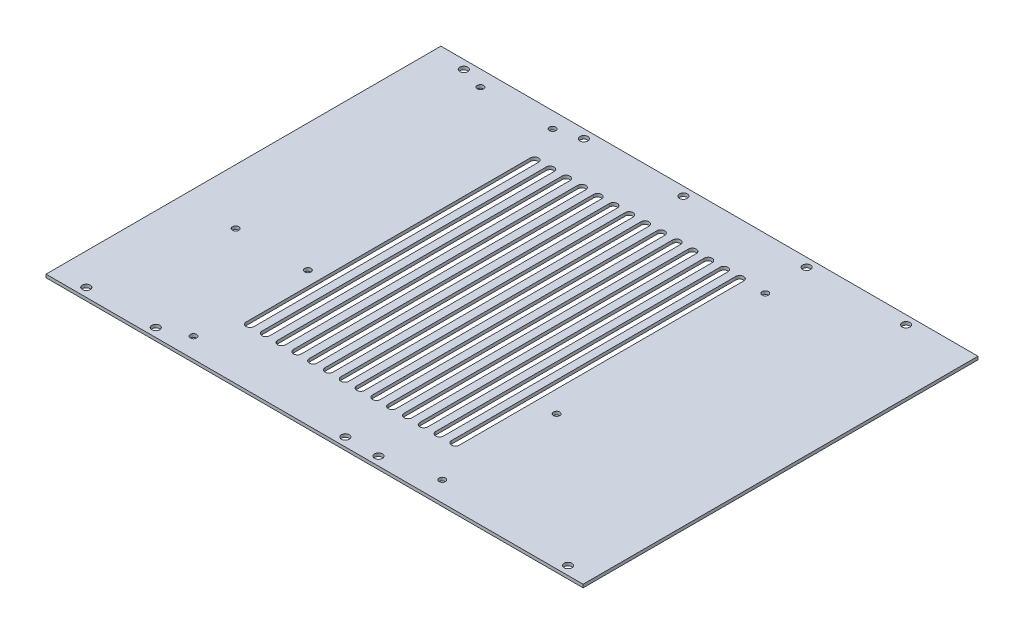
ISO-10303-21;
HEADER;
FILE_DESCRIPTION(('STEP AP214'),'2;1');
FILE_NAME('part.step','',(''),(''),'','','');
FILE_SCHEMA(('AUTOMOTIVE_DESIGN { 1 0 10303 214 1 1 1 1 }'));
ENDSEC;
DATA;
#1=APPLICATION_CONTEXT('core data for automotive mechanical design processes');
#2=APPLICATION_PROTOCOL_DEFINITION('international standard','automotive_design',2000,#1);
#3=PRODUCT_CONTEXT('',#1,'mechanical');
#4=PRODUCT('Part','Part','',(#3));
#5=PRODUCT_RELATED_PRODUCT_CATEGORY('part','',(#4));
#6=PRODUCT_DEFINITION_FORMATION('','',#4);
#7=PRODUCT_DEFINITION_CONTEXT('part definition',#1,'design');
#8=PRODUCT_DEFINITION('design','',#6,#7);
#9=PRODUCT_DEFINITION_SHAPE('','',#8);
#10=(LENGTH_UNIT() NAMED_UNIT(*) SI_UNIT(.MILLI.,.METRE.));
#11=(NAMED_UNIT(*) PLANE_ANGLE_UNIT() SI_UNIT($,.RADIAN.));
#12=(NAMED_UNIT(*) SI_UNIT($,.STERADIAN.) SOLID_ANGLE_UNIT());
#13=UNCERTAINTY_MEASURE_WITH_UNIT(LENGTH_MEASURE(1.E-05),#10,'distance_accuracy_value','');
#14=(GEOMETRIC_REPRESENTATION_CONTEXT(3) GLOBAL_UNCERTAINTY_ASSIGNED_CONTEXT((#13)) GLOBAL_UNIT_ASSIGNED_CONTEXT((#10,
#11,#12)) REPRESENTATION_CONTEXT('',''));
#15=CARTESIAN_POINT('',(0.,0.,0.));
#16=DIRECTION('',(0.,0.,1.));
#17=DIRECTION('',(1.,0.,0.));
#18=AXIS2_PLACEMENT_3D('',#15,#16,#17);
#19=CARTESIAN_POINT('',(0.,2.,0.));
#20=DIRECTION('',(0.,1.,0.));
#21=DIRECTION('',(0.,0.,1.));
#22=AXIS2_PLACEMENT_3D('',#19,#20,#21);
#23=PLANE('',#22);
#24=DIRECTION('',(0.,0.,1.));
#25=VECTOR('',#24,1.);
#26=CARTESIAN_POINT('',(49.5828636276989,2.,-92.0939147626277));
#27=LINE('',#26,#25);
#28=CARTESIAN_POINT('',(49.5828636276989,2.,-92.0939147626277));
#29=VERTEX_POINT('',#28);
#30=CARTESIAN_POINT('',(49.582863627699,2.,87.9060852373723));
#31=VERTEX_POINT('',#30);
#32=EDGE_CURVE('E426',#29,#31,#27,.T.);
#33=ORIENTED_EDGE('',*,*,#32,.F.);
#34=CARTESIAN_POINT('',(52.0828636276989,2.,-92.0939147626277));
#35=DIRECTION('',(0.,1.,0.));
#36=DIRECTION('',(0.,0.,1.));
#37=AXIS2_PLACEMENT_3D('',#34,#35,#36);
#38=CIRCLE('',#37,2.5);
#39=CARTESIAN_POINT('',(54.5828636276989,2.,-92.0939147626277));
#40=VERTEX_POINT('',#39);
#41=EDGE_CURVE('E417',#40,#29,#38,.T.);
#42=ORIENTED_EDGE('',*,*,#41,.F.);
#43=DIRECTION('',(0.,0.,-1.));
#44=VECTOR('',#43,1.);
#45=CARTESIAN_POINT('',(54.5828636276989,2.,-92.0939147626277));
#46=LINE('',#45,#44);
#47=CARTESIAN_POINT('',(54.5828636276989,2.,87.9060852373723));
#48=VERTEX_POINT('',#47);
#49=EDGE_CURVE('E444',#48,#40,#46,.T.);
#50=ORIENTED_EDGE('',*,*,#49,.F.);
#51=CARTESIAN_POINT('',(52.0828636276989,2.,87.9060852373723));
#52=DIRECTION('',(0.,1.,0.));
#53=DIRECTION('',(0.,0.,1.));
#54=AXIS2_PLACEMENT_3D('',#51,#52,#53);
#55=CIRCLE('',#54,2.49999999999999);
#56=EDGE_CURVE('E440',#31,#48,#55,.T.);
#57=ORIENTED_EDGE('',*,*,#56,.F.);
#58=EDGE_LOOP('',(#33,#42,#50,#57));
#59=FACE_BOUND('',#58,.T.);
#60=DIRECTION('',(0.,0.,1.));
#61=VECTOR('',#60,1.);
#62=CARTESIAN_POINT('',(39.5828636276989,2.,-92.0939147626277));
#63=LINE('',#62,#61);
#64=CARTESIAN_POINT('',(39.5828636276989,2.,-92.0939147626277));
#65=VERTEX_POINT('',#64);
#66=CARTESIAN_POINT('',(39.5828636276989,2.,87.9060852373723));
#67=VERTEX_POINT('',#66);
#68=EDGE_CURVE('E471',#65,#67,#63,.T.);
#69=ORIENTED_EDGE('',*,*,#68,.F.);
#70=CARTESIAN_POINT('',(42.0828636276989,2.,-92.0939147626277));
#71=DIRECTION('',(0.,1.,0.));
#72=DIRECTION('',(0.,0.,1.));
#73=AXIS2_PLACEMENT_3D('',#70,#71,#72);
#74=CIRCLE('',#73,2.5);
#75=CARTESIAN_POINT('',(44.5828636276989,2.,-92.0939147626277));
#76=VERTEX_POINT('',#75);
#77=EDGE_CURVE('E468',#76,#65,#74,.T.);
#78=ORIENTED_EDGE('',*,*,#77,.F.);
#79=DIRECTION('',(0.,0.,-1.));
#80=VECTOR('',#79,1.);
#81=CARTESIAN_POINT('',(44.5828636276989,2.,-92.0939147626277));
#82=LINE('',#81,#80);
#83=CARTESIAN_POINT('',(44.5828636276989,2.,87.9060852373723));
#84=VERTEX_POINT('',#83);
#85=EDGE_CURVE('E479',#84,#76,#82,.T.);
#86=ORIENTED_EDGE('',*,*,#85,.F.);
#87=CARTESIAN_POINT('',(42.0828636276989,2.,87.9060852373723));
#88=DIRECTION('',(0.,1.,0.));
#89=DIRECTION('',(0.,0.,1.));
#90=AXIS2_PLACEMENT_3D('',#87,#88,#89);
#91=CIRCLE('',#90,2.49999999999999);
#92=EDGE_CURVE('E475',#67,#84,#91,.T.);
#93=ORIENTED_EDGE('',*,*,#92,.F.);
#94=EDGE_LOOP('',(#69,#78,#86,#93));
#95=FACE_BOUND('',#94,.T.);
#96=DIRECTION('',(0.,0.,1.));
#97=VECTOR('',#96,1.);
#98=CARTESIAN_POINT('',(29.5828636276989,2.,-92.0939147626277));
#99=LINE('',#98,#97);
#100=CARTESIAN_POINT('',(29.5828636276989,2.,-92.0939147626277));
#101=VERTEX_POINT('',#100);
#102=CARTESIAN_POINT('',(29.5828636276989,2.,87.9060852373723));
#103=VERTEX_POINT('',#102);
#104=EDGE_CURVE('E514',#101,#103,#99,.T.);
#105=ORIENTED_EDGE('',*,*,#104,.F.);
#106=CARTESIAN_POINT('',(32.0828636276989,2.,-92.0939147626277));
#107=DIRECTION('',(0.,1.,0.));
#108=DIRECTION('',(0.,0.,1.));
#109=AXIS2_PLACEMENT_3D('',#106,#107,#108);
#110=CIRCLE('',#109,2.5);
#111=CARTESIAN_POINT('',(34.5828636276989,2.,-92.0939147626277));
#112=VERTEX_POINT('',#111);
#113=EDGE_CURVE('E511',#112,#101,#110,.T.);
#114=ORIENTED_EDGE('',*,*,#113,.F.);
#115=DIRECTION('',(0.,0.,-1.));
#116=VECTOR('',#115,1.);
#117=CARTESIAN_POINT('',(34.5828636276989,2.,-92.0939147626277));
#118=LINE('',#117,#116);
#119=CARTESIAN_POINT('',(34.5828636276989,2.,87.9060852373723));
#120=VERTEX_POINT('',#119);
#121=EDGE_CURVE('E522',#120,#112,#118,.T.);
#122=ORIENTED_EDGE('',*,*,#121,.F.);
#123=CARTESIAN_POINT('',(32.0828636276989,2.,87.9060852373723));
#124=DIRECTION('',(0.,1.,0.));
#125=DIRECTION('',(0.,0.,1.));
#126=AXIS2_PLACEMENT_3D('',#123,#124,#125);
#127=CIRCLE('',#126,2.49999999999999);
#128=EDGE_CURVE('E518',#103,#120,#127,.T.);
#129=ORIENTED_EDGE('',*,*,#128,.F.);
#130=EDGE_LOOP('',(#105,#114,#122,#129));
#131=FACE_BOUND('',#130,.T.);
#132=DIRECTION('',(0.,0.,1.));
#133=VECTOR('',#132,1.);
#134=CARTESIAN_POINT('',(19.5828636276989,2.,-92.0939147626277));
#135=LINE('',#134,#133);
#136=CARTESIAN_POINT('',(19.5828636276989,2.,-92.0939147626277));
#137=VERTEX_POINT('',#136);
#138=CARTESIAN_POINT('',(19.582863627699,2.,87.9060852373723));
#139=VERTEX_POINT('',#138);
#140=EDGE_CURVE('E557',#137,#139,#135,.T.);
#141=ORIENTED_EDGE('',*,*,#140,.F.);
#142=CARTESIAN_POINT('',(22.0828636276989,2.,-92.0939147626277));
#143=DIRECTION('',(0.,1.,0.));
#144=DIRECTION('',(0.,0.,1.));
#145=AXIS2_PLACEMENT_3D('',#142,#143,#144);
#146=CIRCLE('',#145,2.5);
#147=CARTESIAN_POINT('',(24.5828636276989,2.,-92.0939147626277));
#148=VERTEX_POINT('',#147);
#149=EDGE_CURVE('E554',#148,#137,#146,.T.);
#150=ORIENTED_EDGE('',*,*,#149,.F.);
#151=DIRECTION('',(0.,0.,-1.));
#152=VECTOR('',#151,1.);
#153=CARTESIAN_POINT('',(24.5828636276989,2.,-92.0939147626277));
#154=LINE('',#153,#152);
#155=CARTESIAN_POINT('',(24.5828636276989,2.,87.9060852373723));
#156=VERTEX_POINT('',#155);
#157=EDGE_CURVE('E565',#156,#148,#154,.T.);
#158=ORIENTED_EDGE('',*,*,#157,.F.);
#159=CARTESIAN_POINT('',(22.0828636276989,2.,87.9060852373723));
#160=DIRECTION('',(0.,1.,0.));
#161=DIRECTION('',(0.,0.,1.));
#162=AXIS2_PLACEMENT_3D('',#159,#160,#161);
#163=CIRCLE('',#162,2.49999999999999);
#164=EDGE_CURVE('E561',#139,#156,#163,.T.);
#165=ORIENTED_EDGE('',*,*,#164,.F.);
#166=EDGE_LOOP('',(#141,#150,#158,#165));
#167=FACE_BOUND('',#166,.T.);
#168=DIRECTION('',(0.,0.,1.));
#169=VECTOR('',#168,1.);
#170=CARTESIAN_POINT('',(9.5828636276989,2.,-92.0939147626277));
#171=LINE('',#170,#169);
#172=CARTESIAN_POINT('',(9.5828636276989,2.,-92.0939147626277));
#173=VERTEX_POINT('',#172);
#174=CARTESIAN_POINT('',(9.58286362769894,2.,87.9060852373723));
#175=VERTEX_POINT('',#174);
#176=EDGE_CURVE('E600',#173,#175,#171,.T.);
#177=ORIENTED_EDGE('',*,*,#176,.F.);
#178=CARTESIAN_POINT('',(12.0828636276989,2.,-92.0939147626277));
#179=DIRECTION('',(0.,1.,0.));
#180=DIRECTION('',(0.,0.,1.));
#181=AXIS2_PLACEMENT_3D('',#178,#179,#180);
#182=CIRCLE('',#181,2.5);
#183=CARTESIAN_POINT('',(14.5828636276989,2.,-92.0939147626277));
#184=VERTEX_POINT('',#183);
#185=EDGE_CURVE('E597',#184,#173,#182,.T.);
#186=ORIENTED_EDGE('',*,*,#185,.F.);
#187=DIRECTION('',(0.,0.,-1.));
#188=VECTOR('',#187,1.);
#189=CARTESIAN_POINT('',(14.5828636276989,2.,-92.0939147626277));
#190=LINE('',#189,#188);
#191=CARTESIAN_POINT('',(14.5828636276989,2.,87.9060852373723));
#192=VERTEX_POINT('',#191);
#193=EDGE_CURVE('E608',#192,#184,#190,.T.);
#194=ORIENTED_EDGE('',*,*,#193,.F.);
#195=CARTESIAN_POINT('',(12.0828636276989,2.,87.9060852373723));
#196=DIRECTION('',(0.,1.,0.));
#197=DIRECTION('',(0.,0.,1.));
#198=AXIS2_PLACEMENT_3D('',#195,#196,#197);
#199=CIRCLE('',#198,2.49999999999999);
#200=EDGE_CURVE('E604',#175,#192,#199,.T.);
#201=ORIENTED_EDGE('',*,*,#200,.F.);
#202=EDGE_LOOP('',(#177,#186,#194,#201));
#203=FACE_BOUND('',#202,.T.);
#204=DIRECTION('',(0.,0.,1.));
#205=VECTOR('',#204,1.);
#206=CARTESIAN_POINT('',(-0.417136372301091,2.,-92.0939147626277));
#207=LINE('',#206,#205);
#208=CARTESIAN_POINT('',(-0.417136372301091,2.,-92.0939147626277));
#209=VERTEX_POINT('',#208);
#210=CARTESIAN_POINT('',(-0.41713637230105,2.,87.9060852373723));
#211=VERTEX_POINT('',#210);
#212=EDGE_CURVE('E643',#209,#211,#207,.T.);
#213=ORIENTED_EDGE('',*,*,#212,.F.);
#214=CARTESIAN_POINT('',(2.08286362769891,2.,-92.0939147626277));
#215=DIRECTION('',(0.,1.,0.));
#216=DIRECTION('',(0.,0.,1.));
#217=AXIS2_PLACEMENT_3D('',#214,#215,#216);
#218=CIRCLE('',#217,2.5);
#219=CARTESIAN_POINT('',(4.58286362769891,2.,-92.0939147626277));
#220=VERTEX_POINT('',#219);
#221=EDGE_CURVE('E640',#220,#209,#218,.T.);
#222=ORIENTED_EDGE('',*,*,#221,.F.);
#223=DIRECTION('',(0.,0.,-1.));
#224=VECTOR('',#223,1.);
#225=CARTESIAN_POINT('',(4.58286362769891,2.,-92.0939147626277));
#226=LINE('',#225,#224);
#227=CARTESIAN_POINT('',(4.58286362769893,2.,87.9060852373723));
#228=VERTEX_POINT('',#227);
#229=EDGE_CURVE('E651',#228,#220,#226,.T.);
#230=ORIENTED_EDGE('',*,*,#229,.F.);
#231=CARTESIAN_POINT('',(2.08286362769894,2.,87.9060852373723));
#232=DIRECTION('',(0.,1.,0.));
#233=DIRECTION('',(0.,0.,1.));
#234=AXIS2_PLACEMENT_3D('',#231,#232,#233);
#235=CIRCLE('',#234,2.49999999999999);
#236=EDGE_CURVE('E647',#211,#228,#235,.T.);
#237=ORIENTED_EDGE('',*,*,#236,.F.);
#238=EDGE_LOOP('',(#213,#222,#230,#237));
#239=FACE_BOUND('',#238,.T.);
#240=DIRECTION('',(0.,0.,1.));
#241=VECTOR('',#240,1.);
#242=CARTESIAN_POINT('',(-10.4171363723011,2.,-92.0939147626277));
#243=LINE('',#242,#241);
#244=CARTESIAN_POINT('',(-10.4171363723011,2.,-92.0939147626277));
#245=VERTEX_POINT('',#244);
#246=CARTESIAN_POINT('',(-10.417136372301,2.,87.9060852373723));
#247=VERTEX_POINT('',#246);
#248=EDGE_CURVE('E686',#245,#247,#243,.T.);
#249=ORIENTED_EDGE('',*,*,#248,.F.);
#250=CARTESIAN_POINT('',(-7.91713637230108,2.,-92.0939147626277));
#251=DIRECTION('',(0.,1.,0.));
#252=DIRECTION('',(0.,0.,1.));
#253=AXIS2_PLACEMENT_3D('',#250,#251,#252);
#254=CIRCLE('',#253,2.5);
#255=CARTESIAN_POINT('',(-5.41713637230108,2.,-92.0939147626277));
#256=VERTEX_POINT('',#255);
#257=EDGE_CURVE('E683',#256,#245,#254,.T.);
#258=ORIENTED_EDGE('',*,*,#257,.F.);
#259=DIRECTION('',(0.,0.,-1.));
#260=VECTOR('',#259,1.);
#261=CARTESIAN_POINT('',(-5.41713637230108,2.,-92.0939147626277));
#262=LINE('',#261,#260);
#263=CARTESIAN_POINT('',(-5.41713637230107,2.,87.9060852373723));
#264=VERTEX_POINT('',#263);
#265=EDGE_CURVE('E694',#264,#256,#262,.T.);
#266=ORIENTED_EDGE('',*,*,#265,.F.);
#267=CARTESIAN_POINT('',(-7.91713637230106,2.,87.9060852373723));
#268=DIRECTION('',(0.,1.,0.));
#269=DIRECTION('',(0.,0.,1.));
#270=AXIS2_PLACEMENT_3D('',#267,#268,#269);
#271=CIRCLE('',#270,2.49999999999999);
#272=EDGE_CURVE('E690',#247,#264,#271,.T.);
#273=ORIENTED_EDGE('',*,*,#272,.F.);
#274=EDGE_LOOP('',(#249,#258,#266,#273));
#275=FACE_BOUND('',#274,.T.);
#276=DIRECTION('',(0.,0.,1.));
#277=VECTOR('',#276,1.);
#278=CARTESIAN_POINT('',(-20.4171363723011,2.,-92.0939147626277));
#279=LINE('',#278,#277);
#280=CARTESIAN_POINT('',(-20.4171363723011,2.,-92.0939147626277));
#281=VERTEX_POINT('',#280);
#282=CARTESIAN_POINT('',(-20.4171363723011,2.,87.9060852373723));
#283=VERTEX_POINT('',#282);
#284=EDGE_CURVE('E729',#281,#283,#279,.T.);
#285=ORIENTED_EDGE('',*,*,#284,.F.);
#286=CARTESIAN_POINT('',(-17.9171363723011,2.,-92.0939147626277));
#287=DIRECTION('',(0.,1.,0.));
#288=DIRECTION('',(0.,0.,1.));
#289=AXIS2_PLACEMENT_3D('',#286,#287,#288);
#290=CIRCLE('',#289,2.5);
#291=CARTESIAN_POINT('',(-15.4171363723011,2.,-92.0939147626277));
#292=VERTEX_POINT('',#291);
#293=EDGE_CURVE('E726',#292,#281,#290,.T.);
#294=ORIENTED_EDGE('',*,*,#293,.F.);
#295=DIRECTION('',(0.,0.,-1.));
#296=VECTOR('',#295,1.);
#297=CARTESIAN_POINT('',(-15.4171363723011,2.,-92.0939147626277));
#298=LINE('',#297,#296);
#299=CARTESIAN_POINT('',(-15.4171363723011,2.,87.9060852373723));
#300=VERTEX_POINT('',#299);
#301=EDGE_CURVE('E737',#300,#292,#298,.T.);
#302=ORIENTED_EDGE('',*,*,#301,.F.);
#303=CARTESIAN_POINT('',(-17.9171363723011,2.,87.9060852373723));
#304=DIRECTION('',(0.,1.,0.));
#305=DIRECTION('',(0.,0.,1.));
#306=AXIS2_PLACEMENT_3D('',#303,#304,#305);
#307=CIRCLE('',#306,2.49999999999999);
#308=EDGE_CURVE('E733',#283,#300,#307,.T.);
#309=ORIENTED_EDGE('',*,*,#308,.F.);
#310=EDGE_LOOP('',(#285,#294,#302,#309));
#311=FACE_BOUND('',#310,.T.);
#312=DIRECTION('',(0.,0.,1.));
#313=VECTOR('',#312,1.);
#314=CARTESIAN_POINT('',(-30.4171363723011,2.,-92.0939147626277));
#315=LINE('',#314,#313);
#316=CARTESIAN_POINT('',(-30.4171363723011,2.,-92.0939147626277));
#317=VERTEX_POINT('',#316);
#318=CARTESIAN_POINT('',(-30.417136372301,2.,87.9060852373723));
#319=VERTEX_POINT('',#318);
#320=EDGE_CURVE('E772',#317,#319,#315,.T.);
#321=ORIENTED_EDGE('',*,*,#320,.F.);
#322=CARTESIAN_POINT('',(-27.9171363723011,2.,-92.0939147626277));
#323=DIRECTION('',(0.,1.,0.));
#324=DIRECTION('',(0.,0.,1.));
#325=AXIS2_PLACEMENT_3D('',#322,#323,#324);
#326=CIRCLE('',#325,2.5);
#327=CARTESIAN_POINT('',(-25.4171363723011,2.,-92.0939147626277));
#328=VERTEX_POINT('',#327);
#329=EDGE_CURVE('E769',#328,#317,#326,.T.);
#330=ORIENTED_EDGE('',*,*,#329,.F.);
#331=DIRECTION('',(0.,0.,-1.));
#332=VECTOR('',#331,1.);
#333=CARTESIAN_POINT('',(-25.4171363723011,2.,-92.0939147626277));
#334=LINE('',#333,#332);
#335=CARTESIAN_POINT('',(-25.4171363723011,2.,87.9060852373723));
#336=VERTEX_POINT('',#335);
#337=EDGE_CURVE('E780',#336,#328,#334,.T.);
#338=ORIENTED_EDGE('',*,*,#337,.F.);
#339=CARTESIAN_POINT('',(-27.9171363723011,2.,87.9060852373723));
#340=DIRECTION('',(0.,1.,0.));
#341=DIRECTION('',(0.,0.,1.));
#342=AXIS2_PLACEMENT_3D('',#339,#340,#341);
#343=CIRCLE('',#342,2.49999999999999);
#344=EDGE_CURVE('E776',#319,#336,#343,.T.);
#345=ORIENTED_EDGE('',*,*,#344,.F.);
#346=EDGE_LOOP('',(#321,#330,#338,#345));
#347=FACE_BOUND('',#346,.T.);
#348=DIRECTION('',(0.,0.,1.));
#349=VECTOR('',#348,1.);
#350=CARTESIAN_POINT('',(-40.4171363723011,2.,-92.0939147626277));
#351=LINE('',#350,#349);
#352=CARTESIAN_POINT('',(-40.4171363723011,2.,-92.0939147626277));
#353=VERTEX_POINT('',#352);
#354=CARTESIAN_POINT('',(-40.4171363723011,2.,87.9060852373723));
#355=VERTEX_POINT('',#354);
#356=EDGE_CURVE('E815',#353,#355,#351,.T.);
#357=ORIENTED_EDGE('',*,*,#356,.F.);
#358=CARTESIAN_POINT('',(-37.9171363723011,2.,-92.0939147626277));
#359=DIRECTION('',(0.,1.,0.));
#360=DIRECTION('',(0.,0.,1.));
#361=AXIS2_PLACEMENT_3D('',#358,#359,#360);
#362=CIRCLE('',#361,2.5);
#363=CARTESIAN_POINT('',(-35.4171363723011,2.,-92.0939147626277));
#364=VERTEX_POINT('',#363);
#365=EDGE_CURVE('E812',#364,#353,#362,.T.);
#366=ORIENTED_EDGE('',*,*,#365,.F.);
#367=DIRECTION('',(0.,0.,-1.));
#368=VECTOR('',#367,1.);
#369=CARTESIAN_POINT('',(-35.4171363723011,2.,-92.0939147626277));
#370=LINE('',#369,#368);
#371=CARTESIAN_POINT('',(-35.4171363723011,2.,87.9060852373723));
#372=VERTEX_POINT('',#371);
#373=EDGE_CURVE('E823',#372,#364,#370,.T.);
#374=ORIENTED_EDGE('',*,*,#373,.F.);
#375=CARTESIAN_POINT('',(-37.9171363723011,2.,87.9060852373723));
#376=DIRECTION('',(0.,1.,0.));
#377=DIRECTION('',(0.,0.,1.));
#378=AXIS2_PLACEMENT_3D('',#375,#376,#377);
#379=CIRCLE('',#378,2.49999999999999);
#380=EDGE_CURVE('E819',#355,#372,#379,.T.);
#381=ORIENTED_EDGE('',*,*,#380,.F.);
#382=EDGE_LOOP('',(#357,#366,#374,#381));
#383=FACE_BOUND('',#382,.T.);
#384=DIRECTION('',(0.,0.,1.));
#385=VECTOR('',#384,1.);
#386=CARTESIAN_POINT('',(-50.4171363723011,2.,-92.0939147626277));
#387=LINE('',#386,#385);
#388=CARTESIAN_POINT('',(-50.4171363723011,2.,-92.0939147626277));
#389=VERTEX_POINT('',#388);
#390=CARTESIAN_POINT('',(-50.4171363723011,2.,87.9060852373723));
#391=VERTEX_POINT('',#390);
#392=EDGE_CURVE('E858',#389,#391,#387,.T.);
#393=ORIENTED_EDGE('',*,*,#392,.F.);
#394=CARTESIAN_POINT('',(-47.9171363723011,2.,-92.0939147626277));
#395=DIRECTION('',(0.,1.,0.));
#396=DIRECTION('',(0.,0.,1.));
#397=AXIS2_PLACEMENT_3D('',#394,#395,#396);
#398=CIRCLE('',#397,2.5);
#399=CARTESIAN_POINT('',(-45.4171363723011,2.,-92.0939147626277));
#400=VERTEX_POINT('',#399);
#401=EDGE_CURVE('E855',#400,#389,#398,.T.);
#402=ORIENTED_EDGE('',*,*,#401,.F.);
#403=DIRECTION('',(0.,0.,-1.));
#404=VECTOR('',#403,1.);
#405=CARTESIAN_POINT('',(-45.4171363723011,2.,-92.0939147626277));
#406=LINE('',#405,#404);
#407=CARTESIAN_POINT('',(-45.4171363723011,2.,87.9060852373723));
#408=VERTEX_POINT('',#407);
#409=EDGE_CURVE('E866',#408,#400,#406,.T.);
#410=ORIENTED_EDGE('',*,*,#409,.F.);
#411=CARTESIAN_POINT('',(-47.9171363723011,2.,87.9060852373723));
#412=DIRECTION('',(0.,1.,0.));
#413=DIRECTION('',(0.,0.,1.));
#414=AXIS2_PLACEMENT_3D('',#411,#412,#413);
#415=CIRCLE('',#414,2.49999999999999);
#416=EDGE_CURVE('E862',#391,#408,#415,.T.);
#417=ORIENTED_EDGE('',*,*,#416,.F.);
#418=EDGE_LOOP('',(#393,#402,#410,#417));
#419=FACE_BOUND('',#418,.T.);
#420=DIRECTION('',(0.,0.,1.));
#421=VECTOR('',#420,1.);
#422=CARTESIAN_POINT('',(-60.4171363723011,2.,-92.0939147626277));
#423=LINE('',#422,#421);
#424=CARTESIAN_POINT('',(-60.4171363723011,2.,-92.0939147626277));
#425=VERTEX_POINT('',#424);
#426=CARTESIAN_POINT('',(-60.417136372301,2.,87.9060852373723));
#427=VERTEX_POINT('',#426);
#428=EDGE_CURVE('E901',#425,#427,#423,.T.);
#429=ORIENTED_EDGE('',*,*,#428,.F.);
#430=CARTESIAN_POINT('',(-57.9171363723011,2.,-92.0939147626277));
#431=DIRECTION('',(0.,1.,0.));
#432=DIRECTION('',(0.,0.,1.));
#433=AXIS2_PLACEMENT_3D('',#430,#431,#432);
#434=CIRCLE('',#433,2.5);
#435=CARTESIAN_POINT('',(-55.4171363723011,2.,-92.0939147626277));
#436=VERTEX_POINT('',#435);
#437=EDGE_CURVE('E898',#436,#425,#434,.T.);
#438=ORIENTED_EDGE('',*,*,#437,.F.);
#439=DIRECTION('',(0.,0.,-1.));
#440=VECTOR('',#439,1.);
#441=CARTESIAN_POINT('',(-55.4171363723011,2.,-92.0939147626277));
#442=LINE('',#441,#440);
#443=CARTESIAN_POINT('',(-55.4171363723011,2.,87.9060852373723));
#444=VERTEX_POINT('',#443);
#445=EDGE_CURVE('E909',#444,#436,#442,.T.);
#446=ORIENTED_EDGE('',*,*,#445,.F.);
#447=CARTESIAN_POINT('',(-57.9171363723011,2.,87.9060852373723));
#448=DIRECTION('',(0.,1.,0.));
#449=DIRECTION('',(0.,0.,1.));
#450=AXIS2_PLACEMENT_3D('',#447,#448,#449);
#451=CIRCLE('',#450,2.49999999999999);
#452=EDGE_CURVE('E905',#427,#444,#451,.T.);
#453=ORIENTED_EDGE('',*,*,#452,.F.);
#454=EDGE_LOOP('',(#429,#438,#446,#453));
#455=FACE_BOUND('',#454,.T.);
#456=DIRECTION('',(0.,0.,1.));
#457=VECTOR('',#456,1.);
#458=CARTESIAN_POINT('',(-70.4171363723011,2.,-92.0939147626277));
#459=LINE('',#458,#457);
#460=CARTESIAN_POINT('',(-70.4171363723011,2.,-92.0939147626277));
#461=VERTEX_POINT('',#460);
#462=CARTESIAN_POINT('',(-70.4171363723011,2.,87.9060852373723));
#463=VERTEX_POINT('',#462);
#464=EDGE_CURVE('E944',#461,#463,#459,.T.);
#465=ORIENTED_EDGE('',*,*,#464,.F.);
#466=CARTESIAN_POINT('',(-67.9171363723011,2.,-92.0939147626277));
#467=DIRECTION('',(0.,1.,0.));
#468=DIRECTION('',(0.,0.,1.));
#469=AXIS2_PLACEMENT_3D('',#466,#467,#468);
#470=CIRCLE('',#469,2.5);
#471=CARTESIAN_POINT('',(-65.4171363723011,2.,-92.0939147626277));
#472=VERTEX_POINT('',#471);
#473=EDGE_CURVE('E941',#472,#461,#470,.T.);
#474=ORIENTED_EDGE('',*,*,#473,.F.);
#475=DIRECTION('',(0.,0.,-1.));
#476=VECTOR('',#475,1.);
#477=CARTESIAN_POINT('',(-65.4171363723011,2.,-92.0939147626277));
#478=LINE('',#477,#476);
#479=CARTESIAN_POINT('',(-65.4171363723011,2.,87.9060852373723));
#480=VERTEX_POINT('',#479);
#481=EDGE_CURVE('E952',#480,#472,#478,.T.);
#482=ORIENTED_EDGE('',*,*,#481,.F.);
#483=CARTESIAN_POINT('',(-67.9171363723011,2.,87.9060852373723));
#484=DIRECTION('',(0.,1.,0.));
#485=DIRECTION('',(0.,0.,1.));
#486=AXIS2_PLACEMENT_3D('',#483,#484,#485);
#487=CIRCLE('',#486,2.49999999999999);
#488=EDGE_CURVE('E948',#463,#480,#487,.T.);
#489=ORIENTED_EDGE('',*,*,#488,.F.);
#490=EDGE_LOOP('',(#465,#474,#482,#489));
#491=FACE_BOUND('',#490,.T.);
#492=CARTESIAN_POINT('',(-150.,2.,119.5));
#493=DIRECTION('',(0.,1.,0.));
#494=DIRECTION('',(0.,0.,1.));
#495=AXIS2_PLACEMENT_3D('',#492,#493,#494);
#496=CIRCLE('',#495,2.5);
#497=CARTESIAN_POINT('',(-150.,2.,122.));
#498=VERTEX_POINT('',#497);
#499=EDGE_CURVE('E984',#498,#498,#496,.T.);
#500=ORIENTED_EDGE('',*,*,#499,.F.);
#501=EDGE_LOOP('',(#500));
#502=FACE_BOUND('',#501,.T.);
#503=CARTESIAN_POINT('',(35.0000000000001,2.,119.5));
#504=DIRECTION('',(0.,1.,0.));
#505=DIRECTION('',(0.,0.,1.));
#506=AXIS2_PLACEMENT_3D('',#503,#504,#505);
#507=CIRCLE('',#506,2.5);
#508=CARTESIAN_POINT('',(35.0000000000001,2.,122.));
#509=VERTEX_POINT('',#508);
#510=EDGE_CURVE('E1000',#509,#509,#507,.T.);
#511=ORIENTED_EDGE('',*,*,#510,.F.);
#512=EDGE_LOOP('',(#511));
#513=FACE_BOUND('',#512,.T.);
#514=DIRECTION('',(0.,0.,1.));
#515=VECTOR('',#514,1.);
#516=CARTESIAN_POINT('',(-80.4171363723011,2.,-92.0939147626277));
#517=LINE('',#516,#515);
#518=CARTESIAN_POINT('',(-80.4171363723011,2.,-92.0939147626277));
#519=VERTEX_POINT('',#518);
#520=CARTESIAN_POINT('',(-80.4171363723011,2.,87.9060852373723));
#521=VERTEX_POINT('',#520);
#522=EDGE_CURVE('E1019',#519,#521,#517,.T.);
#523=ORIENTED_EDGE('',*,*,#522,.F.);
#524=CARTESIAN_POINT('',(-77.9171363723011,2.,-92.0939147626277));
#525=DIRECTION('',(0.,1.,0.));
#526=DIRECTION('',(0.,0.,1.));
#527=AXIS2_PLACEMENT_3D('',#524,#525,#526);
#528=CIRCLE('',#527,2.5);
#529=CARTESIAN_POINT('',(-75.4171363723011,2.,-92.0939147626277));
#530=VERTEX_POINT('',#529);
#531=EDGE_CURVE('E1016',#530,#519,#528,.T.);
#532=ORIENTED_EDGE('',*,*,#531,.F.);
#533=DIRECTION('',(0.,0.,-1.));
#534=VECTOR('',#533,1.);
#535=CARTESIAN_POINT('',(-75.4171363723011,2.,-92.0939147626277));
#536=LINE('',#535,#534);
#537=CARTESIAN_POINT('',(-75.4171363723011,2.,87.9060852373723));
#538=VERTEX_POINT('',#537);
#539=EDGE_CURVE('E1027',#538,#530,#536,.T.);
#540=ORIENTED_EDGE('',*,*,#539,.F.);
#541=CARTESIAN_POINT('',(-77.9171363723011,2.,87.9060852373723));
#542=DIRECTION('',(0.,1.,0.));
#543=DIRECTION('',(0.,0.,1.));
#544=AXIS2_PLACEMENT_3D('',#541,#542,#543);
#545=CIRCLE('',#544,2.49999999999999);
#546=EDGE_CURVE('E1023',#521,#538,#545,.T.);
#547=ORIENTED_EDGE('',*,*,#546,.F.);
#548=EDGE_LOOP('',(#523,#532,#540,#547));
#549=FACE_BOUND('',#548,.T.);
#550=CARTESIAN_POINT('',(-106.,2.,119.5));
#551=DIRECTION('',(0.,1.,0.));
#552=DIRECTION('',(0.,0.,1.));
#553=AXIS2_PLACEMENT_3D('',#550,#551,#552);
#554=CIRCLE('',#553,2.5);
#555=CARTESIAN_POINT('',(-106.,2.,122.));
#556=VERTEX_POINT('',#555);
#557=EDGE_CURVE('E1059',#556,#556,#554,.T.);
#558=ORIENTED_EDGE('',*,*,#557,.F.);
#559=EDGE_LOOP('',(#558));
#560=FACE_BOUND('',#559,.T.);
#561=CARTESIAN_POINT('',(-11.0000000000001,2.,-119.5));
#562=DIRECTION('',(0.,1.,0.));
#563=DIRECTION('',(0.,0.,1.));
#564=AXIS2_PLACEMENT_3D('',#561,#562,#563);
#565=CIRCLE('',#564,2.5);
#566=CARTESIAN_POINT('',(-11.0000000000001,2.,-117.));
#567=VERTEX_POINT('',#566);
#568=EDGE_CURVE('E1075',#567,#567,#565,.T.);
#569=ORIENTED_EDGE('',*,*,#568,.F.);
#570=EDGE_LOOP('',(#569));
#571=FACE_BOUND('',#570,.T.);
#572=CARTESIAN_POINT('',(130.,2.,-119.5));
#573=DIRECTION('',(0.,1.,0.));
#574=DIRECTION('',(0.,0.,1.));
#575=AXIS2_PLACEMENT_3D('',#572,#573,#574);
#576=CIRCLE('',#575,2.5);
#577=CARTESIAN_POINT('',(130.,2.,-117.));
#578=VERTEX_POINT('',#577);
#579=EDGE_CURVE('E1091',#578,#578,#576,.T.);
#580=ORIENTED_EDGE('',*,*,#579,.F.);
#581=EDGE_LOOP('',(#580));
#582=FACE_BOUND('',#581,.T.);
#583=CARTESIAN_POINT('',(-89.2800000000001,2.,39.94));
#584=DIRECTION('',(0.,1.,0.));
#585=DIRECTION('',(0.,0.,1.));
#586=AXIS2_PLACEMENT_3D('',#583,#584,#585);
#587=CIRCLE('',#586,2.);
#588=CARTESIAN_POINT('',(-89.2800000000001,2.,41.94));
#589=VERTEX_POINT('',#588);
#590=EDGE_CURVE('E1107',#589,#589,#587,.T.);
#591=ORIENTED_EDGE('',*,*,#590,.F.);
#592=EDGE_LOOP('',(#591));
#593=FACE_BOUND('',#592,.T.);
#594=CARTESIAN_POINT('',(68.1999999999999,2.,-92.14));
#595=DIRECTION('',(0.,1.,0.));
#596=DIRECTION('',(0.,0.,1.));
#597=AXIS2_PLACEMENT_3D('',#594,#595,#596);
#598=CIRCLE('',#597,2.);
#599=CARTESIAN_POINT('',(68.1999999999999,2.,-90.14));
#600=VERTEX_POINT('',#599);
#601=EDGE_CURVE('E1123',#600,#600,#598,.T.);
#602=ORIENTED_EDGE('',*,*,#601,.F.);
#603=EDGE_LOOP('',(#602));
#604=FACE_BOUND('',#603,.T.);
#605=CARTESIAN_POINT('',(-89.2800000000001,2.,-115.));
#606=DIRECTION('',(0.,1.,0.));
#607=DIRECTION('',(0.,0.,1.));
#608=AXIS2_PLACEMENT_3D('',#605,#606,#607);
#609=CIRCLE('',#608,2.);
#610=CARTESIAN_POINT('',(-89.2800000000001,2.,-113.));
#611=VERTEX_POINT('',#610);
#612=EDGE_CURVE('E1139',#611,#611,#609,.T.);
#613=ORIENTED_EDGE('',*,*,#612,.F.);
#614=EDGE_LOOP('',(#613));
#615=FACE_BOUND('',#614,.T.);
#616=CARTESIAN_POINT('',(-135.,2.,-115.));
#617=DIRECTION('',(0.,1.,0.));
#618=DIRECTION('',(0.,0.,1.));
#619=AXIS2_PLACEMENT_3D('',#616,#617,#618);
#620=CIRCLE('',#619,2.);
#621=CARTESIAN_POINT('',(-135.,2.,-113.));
#622=VERTEX_POINT('',#621);
#623=EDGE_CURVE('E1155',#622,#622,#620,.T.);
#624=ORIENTED_EDGE('',*,*,#623,.F.);
#625=EDGE_LOOP('',(#624));
#626=FACE_BOUND('',#625,.T.);
#627=DIRECTION('',(0.,0.,-1.));
#628=VECTOR('',#627,1.);
#629=CARTESIAN_POINT('',(170.,2.,-125.));
#630=LINE('',#629,#628);
#631=CARTESIAN_POINT('',(170.,2.,125.));
#632=VERTEX_POINT('',#631);
#633=CARTESIAN_POINT('',(170.,2.,-125.));
#634=VERTEX_POINT('',#633);
#635=EDGE_CURVE('E1163',#632,#634,#630,.T.);
#636=ORIENTED_EDGE('',*,*,#635,.T.);
#637=DIRECTION('',(-1.,0.,0.));
#638=VECTOR('',#637,1.);
#639=CARTESIAN_POINT('',(-170.,2.,-125.));
#640=LINE('',#639,#638);
#641=CARTESIAN_POINT('',(-170.,2.,-125.));
#642=VERTEX_POINT('',#641);
#643=EDGE_CURVE('E1167',#634,#642,#640,.T.);
#644=ORIENTED_EDGE('',*,*,#643,.T.);
#645=DIRECTION('',(0.,0.,1.));
#646=VECTOR('',#645,1.);
#647=CARTESIAN_POINT('',(-170.,2.,-125.));
#648=LINE('',#647,#646);
#649=CARTESIAN_POINT('',(-170.,2.,125.));
#650=VERTEX_POINT('',#649);
#651=EDGE_CURVE('E1171',#642,#650,#648,.T.);
#652=ORIENTED_EDGE('',*,*,#651,.T.);
#653=DIRECTION('',(1.,0.,0.));
#654=VECTOR('',#653,1.);
#655=CARTESIAN_POINT('',(-170.,2.,125.));
#656=LINE('',#655,#654);
#657=EDGE_CURVE('E1174',#650,#632,#656,.T.);
#658=ORIENTED_EDGE('',*,*,#657,.T.);
#659=EDGE_LOOP('',(#636,#644,#652,#658));
#660=FACE_BOUND('',#659,.T.);
#661=CARTESIAN_POINT('',(-89.2800000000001,2.,112.33));
#662=DIRECTION('',(0.,1.,0.));
#663=DIRECTION('',(0.,0.,1.));
#664=AXIS2_PLACEMENT_3D('',#661,#662,#663);
#665=CIRCLE('',#664,2.);
#666=CARTESIAN_POINT('',(-89.2800000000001,2.,114.33));
#667=VERTEX_POINT('',#666);
#668=EDGE_CURVE('E1147',#667,#667,#665,.T.);
#669=ORIENTED_EDGE('',*,*,#668,.F.);
#670=EDGE_LOOP('',(#669));
#671=FACE_BOUND('',#670,.T.);
#672=CARTESIAN_POINT('',(68.1999999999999,2.,112.33));
#673=DIRECTION('',(0.,1.,0.));
#674=DIRECTION('',(0.,0.,1.));
#675=AXIS2_PLACEMENT_3D('',#672,#673,#674);
#676=CIRCLE('',#675,2.);
#677=CARTESIAN_POINT('',(68.1999999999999,2.,114.33));
#678=VERTEX_POINT('',#677);
#679=EDGE_CURVE('E1131',#678,#678,#676,.T.);
#680=ORIENTED_EDGE('',*,*,#679,.F.);
#681=EDGE_LOOP('',(#680));
#682=FACE_BOUND('',#681,.T.);
#683=CARTESIAN_POINT('',(-135.,2.,39.94));
#684=DIRECTION('',(0.,1.,0.));
#685=DIRECTION('',(0.,0.,1.));
#686=AXIS2_PLACEMENT_3D('',#683,#684,#685);
#687=CIRCLE('',#686,2.);
#688=CARTESIAN_POINT('',(-135.,2.,41.94));
#689=VERTEX_POINT('',#688);
#690=EDGE_CURVE('E1115',#689,#689,#687,.T.);
#691=ORIENTED_EDGE('',*,*,#690,.F.);
#692=EDGE_LOOP('',(#691));
#693=FACE_BOUND('',#692,.T.);
#694=CARTESIAN_POINT('',(68.1999999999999,2.,39.94));
#695=DIRECTION('',(0.,1.,0.));
#696=DIRECTION('',(0.,0.,1.));
#697=AXIS2_PLACEMENT_3D('',#694,#695,#696);
#698=CIRCLE('',#697,2.);
#699=CARTESIAN_POINT('',(68.1999999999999,2.,41.94));
#700=VERTEX_POINT('',#699);
#701=EDGE_CURVE('E1099',#700,#700,#698,.T.);
#702=ORIENTED_EDGE('',*,*,#701,.F.);
#703=EDGE_LOOP('',(#702));
#704=FACE_BOUND('',#703,.T.);
#705=CARTESIAN_POINT('',(67.,2.,-119.5));
#706=DIRECTION('',(0.,1.,0.));
#707=DIRECTION('',(0.,0.,1.));
#708=AXIS2_PLACEMENT_3D('',#705,#706,#707);
#709=CIRCLE('',#708,2.5);
#710=CARTESIAN_POINT('',(67.,2.,-117.));
#711=VERTEX_POINT('',#710);
#712=EDGE_CURVE('E1083',#711,#711,#709,.T.);
#713=ORIENTED_EDGE('',*,*,#712,.F.);
#714=EDGE_LOOP('',(#713));
#715=FACE_BOUND('',#714,.T.);
#716=CARTESIAN_POINT('',(-74.0000000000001,2.,-119.5));
#717=DIRECTION('',(0.,1.,0.));
#718=DIRECTION('',(0.,0.,1.));
#719=AXIS2_PLACEMENT_3D('',#716,#717,#718);
#720=CIRCLE('',#719,2.5);
#721=CARTESIAN_POINT('',(-74.0000000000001,2.,-117.));
#722=VERTEX_POINT('',#721);
#723=EDGE_CURVE('E1067',#722,#722,#720,.T.);
#724=ORIENTED_EDGE('',*,*,#723,.F.);
#725=EDGE_LOOP('',(#724));
#726=FACE_BOUND('',#725,.T.);
#727=CARTESIAN_POINT('',(14.,2.,119.5));
#728=DIRECTION('',(0.,1.,0.));
#729=DIRECTION('',(0.,0.,1.));
#730=AXIS2_PLACEMENT_3D('',#727,#728,#729);
#731=CIRCLE('',#730,2.5);
#732=CARTESIAN_POINT('',(14.,2.,122.));
#733=VERTEX_POINT('',#732);
#734=EDGE_CURVE('E1008',#733,#733,#731,.T.);
#735=ORIENTED_EDGE('',*,*,#734,.F.);
#736=EDGE_LOOP('',(#735));
#737=FACE_BOUND('',#736,.T.);
#738=CARTESIAN_POINT('',(155.,2.,119.5));
#739=DIRECTION('',(0.,1.,0.));
#740=DIRECTION('',(0.,0.,1.));
#741=AXIS2_PLACEMENT_3D('',#738,#739,#740);
#742=CIRCLE('',#741,2.5);
#743=CARTESIAN_POINT('',(155.,2.,122.));
#744=VERTEX_POINT('',#743);
#745=EDGE_CURVE('E992',#744,#744,#742,.T.);
#746=ORIENTED_EDGE('',*,*,#745,.F.);
#747=EDGE_LOOP('',(#746));
#748=FACE_BOUND('',#747,.T.);
#749=CARTESIAN_POINT('',(-150.,2.,-119.5));
#750=DIRECTION('',(0.,1.,0.));
#751=DIRECTION('',(0.,0.,1.));
#752=AXIS2_PLACEMENT_3D('',#749,#750,#751);
#753=CIRCLE('',#752,2.5);
#754=CARTESIAN_POINT('',(-150.,2.,-117.));
#755=VERTEX_POINT('',#754);
#756=EDGE_CURVE('E452',#755,#755,#753,.T.);
#757=ORIENTED_EDGE('',*,*,#756,.F.);
#758=EDGE_LOOP('',(#757));
#759=FACE_BOUND('',#758,.T.);
#760=ADVANCED_FACE('F39',(#59,#95,#131,#167,#203,#239,#275,#311,#347,#383,#419,#455,#491,#502,
#513,#549,#560,#571,#582,#593,#604,#615,#626,#660,#671,#682,#693,#704,#715,#726,#737,#748,#759),
#23,.T.);
#761=CARTESIAN_POINT('',(0.,0.,0.));
#762=DIRECTION('',(0.,1.,0.));
#763=DIRECTION('',(0.,0.,1.));
#764=AXIS2_PLACEMENT_3D('',#761,#762,#763);
#765=PLANE('',#764);
#766=CARTESIAN_POINT('',(42.0828636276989,0.,-92.0939147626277));
#767=DIRECTION('',(0.,1.,0.));
#768=DIRECTION('',(0.,0.,1.));
#769=AXIS2_PLACEMENT_3D('',#766,#767,#768);
#770=CIRCLE('',#769,2.5);
#771=CARTESIAN_POINT('',(44.5828636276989,0.,-92.0939147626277));
#772=VERTEX_POINT('',#771);
#773=CARTESIAN_POINT('',(39.5828636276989,0.,-92.0939147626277));
#774=VERTEX_POINT('',#773);
#775=EDGE_CURVE('E435',#772,#774,#770,.T.);
#776=ORIENTED_EDGE('',*,*,#775,.T.);
#777=DIRECTION('',(0.,0.,1.));
#778=VECTOR('',#777,1.);
#779=CARTESIAN_POINT('',(39.5828636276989,0.,-92.0939147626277));
#780=LINE('',#779,#778);
#781=CARTESIAN_POINT('',(39.5828636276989,0.,87.9060852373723));
#782=VERTEX_POINT('',#781);
#783=EDGE_CURVE('E486',#774,#782,#780,.T.);
#784=ORIENTED_EDGE('',*,*,#783,.T.);
#785=CARTESIAN_POINT('',(42.0828636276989,0.,87.9060852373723));
#786=DIRECTION('',(0.,1.,0.));
#787=DIRECTION('',(0.,0.,1.));
#788=AXIS2_PLACEMENT_3D('',#785,#786,#787);
#789=CIRCLE('',#788,2.49999999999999);
#790=CARTESIAN_POINT('',(44.5828636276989,0.,87.9060852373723));
#791=VERTEX_POINT('',#790);
#792=EDGE_CURVE('E490',#782,#791,#789,.T.);
#793=ORIENTED_EDGE('',*,*,#792,.T.);
#794=DIRECTION('',(0.,0.,-1.));
#795=VECTOR('',#794,1.);
#796=CARTESIAN_POINT('',(44.5828636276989,0.,-92.0939147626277));
#797=LINE('',#796,#795);
#798=EDGE_CURVE('E472',#791,#772,#797,.T.);
#799=ORIENTED_EDGE('',*,*,#798,.T.);
#800=EDGE_LOOP('',(#776,#784,#793,#799));
#801=FACE_BOUND('',#800,.T.);
#802=CARTESIAN_POINT('',(22.0828636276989,0.,-92.0939147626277));
#803=DIRECTION('',(0.,1.,0.));
#804=DIRECTION('',(0.,0.,1.));
#805=AXIS2_PLACEMENT_3D('',#802,#803,#804);
#806=CIRCLE('',#805,2.5);
#807=CARTESIAN_POINT('',(24.5828636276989,0.,-92.0939147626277));
#808=VERTEX_POINT('',#807);
#809=CARTESIAN_POINT('',(19.5828636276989,0.,-92.0939147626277));
#810=VERTEX_POINT('',#809);
#811=EDGE_CURVE('E553',#808,#810,#806,.T.);
#812=ORIENTED_EDGE('',*,*,#811,.T.);
#813=DIRECTION('',(0.,0.,1.));
#814=VECTOR('',#813,1.);
#815=CARTESIAN_POINT('',(19.5828636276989,0.,-92.0939147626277));
#816=LINE('',#815,#814);
#817=CARTESIAN_POINT('',(19.582863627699,0.,87.9060852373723));
#818=VERTEX_POINT('',#817);
#819=EDGE_CURVE('E572',#810,#818,#816,.T.);
#820=ORIENTED_EDGE('',*,*,#819,.T.);
#821=CARTESIAN_POINT('',(22.0828636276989,0.,87.9060852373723));
#822=DIRECTION('',(0.,1.,0.));
#823=DIRECTION('',(0.,0.,1.));
#824=AXIS2_PLACEMENT_3D('',#821,#822,#823);
#825=CIRCLE('',#824,2.49999999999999);
#826=CARTESIAN_POINT('',(24.5828636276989,0.,87.9060852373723));
#827=VERTEX_POINT('',#826);
#828=EDGE_CURVE('E576',#818,#827,#825,.T.);
#829=ORIENTED_EDGE('',*,*,#828,.T.);
#830=DIRECTION('',(0.,0.,-1.));
#831=VECTOR('',#830,1.);
#832=CARTESIAN_POINT('',(24.5828636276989,0.,-92.0939147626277));
#833=LINE('',#832,#831);
#834=EDGE_CURVE('E558',#827,#808,#833,.T.);
#835=ORIENTED_EDGE('',*,*,#834,.T.);
#836=EDGE_LOOP('',(#812,#820,#829,#835));
#837=FACE_BOUND('',#836,.T.);
#838=CARTESIAN_POINT('',(2.08286362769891,0.,-92.0939147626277));
#839=DIRECTION('',(0.,1.,0.));
#840=DIRECTION('',(0.,0.,1.));
#841=AXIS2_PLACEMENT_3D('',#838,#839,#840);
#842=CIRCLE('',#841,2.5);
#843=CARTESIAN_POINT('',(4.58286362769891,0.,-92.0939147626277));
#844=VERTEX_POINT('',#843);
#845=CARTESIAN_POINT('',(-0.417136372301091,0.,-92.0939147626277));
#846=VERTEX_POINT('',#845);
#847=EDGE_CURVE('E639',#844,#846,#842,.T.);
#848=ORIENTED_EDGE('',*,*,#847,.T.);
#849=DIRECTION('',(0.,0.,1.));
#850=VECTOR('',#849,1.);
#851=CARTESIAN_POINT('',(-0.417136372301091,0.,-92.0939147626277));
#852=LINE('',#851,#850);
#853=CARTESIAN_POINT('',(-0.41713637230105,0.,87.9060852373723));
#854=VERTEX_POINT('',#853);
#855=EDGE_CURVE('E658',#846,#854,#852,.T.);
#856=ORIENTED_EDGE('',*,*,#855,.T.);
#857=CARTESIAN_POINT('',(2.08286362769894,0.,87.9060852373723));
#858=DIRECTION('',(0.,1.,0.));
#859=DIRECTION('',(0.,0.,1.));
#860=AXIS2_PLACEMENT_3D('',#857,#858,#859);
#861=CIRCLE('',#860,2.49999999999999);
#862=CARTESIAN_POINT('',(4.58286362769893,0.,87.9060852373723));
#863=VERTEX_POINT('',#862);
#864=EDGE_CURVE('E662',#854,#863,#861,.T.);
#865=ORIENTED_EDGE('',*,*,#864,.T.);
#866=DIRECTION('',(0.,0.,-1.));
#867=VECTOR('',#866,1.);
#868=CARTESIAN_POINT('',(4.58286362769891,0.,-92.0939147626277));
#869=LINE('',#868,#867);
#870=EDGE_CURVE('E644',#863,#844,#869,.T.);
#871=ORIENTED_EDGE('',*,*,#870,.T.);
#872=EDGE_LOOP('',(#848,#856,#865,#871));
#873=FACE_BOUND('',#872,.T.);
#874=CARTESIAN_POINT('',(-17.9171363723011,0.,-92.0939147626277));
#875=DIRECTION('',(0.,1.,0.));
#876=DIRECTION('',(0.,0.,1.));
#877=AXIS2_PLACEMENT_3D('',#874,#875,#876);
#878=CIRCLE('',#877,2.5);
#879=CARTESIAN_POINT('',(-15.4171363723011,0.,-92.0939147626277));
#880=VERTEX_POINT('',#879);
#881=CARTESIAN_POINT('',(-20.4171363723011,0.,-92.0939147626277));
#882=VERTEX_POINT('',#881);
#883=EDGE_CURVE('E725',#880,#882,#878,.T.);
#884=ORIENTED_EDGE('',*,*,#883,.T.);
#885=DIRECTION('',(0.,0.,1.));
#886=VECTOR('',#885,1.);
#887=CARTESIAN_POINT('',(-20.4171363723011,0.,-92.0939147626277));
#888=LINE('',#887,#886);
#889=CARTESIAN_POINT('',(-20.4171363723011,0.,87.9060852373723));
#890=VERTEX_POINT('',#889);
#891=EDGE_CURVE('E744',#882,#890,#888,.T.);
#892=ORIENTED_EDGE('',*,*,#891,.T.);
#893=CARTESIAN_POINT('',(-17.9171363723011,0.,87.9060852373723));
#894=DIRECTION('',(0.,1.,0.));
#895=DIRECTION('',(0.,0.,1.));
#896=AXIS2_PLACEMENT_3D('',#893,#894,#895);
#897=CIRCLE('',#896,2.49999999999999);
#898=CARTESIAN_POINT('',(-15.4171363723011,0.,87.9060852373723));
#899=VERTEX_POINT('',#898);
#900=EDGE_CURVE('E748',#890,#899,#897,.T.);
#901=ORIENTED_EDGE('',*,*,#900,.T.);
#902=DIRECTION('',(0.,0.,-1.));
#903=VECTOR('',#902,1.);
#904=CARTESIAN_POINT('',(-15.4171363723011,0.,-92.0939147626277));
#905=LINE('',#904,#903);
#906=EDGE_CURVE('E730',#899,#880,#905,.T.);
#907=ORIENTED_EDGE('',*,*,#906,.T.);
#908=EDGE_LOOP('',(#884,#892,#901,#907));
#909=FACE_BOUND('',#908,.T.);
#910=CARTESIAN_POINT('',(-37.9171363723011,0.,-92.0939147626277));
#911=DIRECTION('',(0.,1.,0.));
#912=DIRECTION('',(0.,0.,1.));
#913=AXIS2_PLACEMENT_3D('',#910,#911,#912);
#914=CIRCLE('',#913,2.5);
#915=CARTESIAN_POINT('',(-35.4171363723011,0.,-92.0939147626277));
#916=VERTEX_POINT('',#915);
#917=CARTESIAN_POINT('',(-40.4171363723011,0.,-92.0939147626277));
#918=VERTEX_POINT('',#917);
#919=EDGE_CURVE('E811',#916,#918,#914,.T.);
#920=ORIENTED_EDGE('',*,*,#919,.T.);
#921=DIRECTION('',(0.,0.,1.));
#922=VECTOR('',#921,1.);
#923=CARTESIAN_POINT('',(-40.4171363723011,0.,-92.0939147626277));
#924=LINE('',#923,#922);
#925=CARTESIAN_POINT('',(-40.4171363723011,0.,87.9060852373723));
#926=VERTEX_POINT('',#925);
#927=EDGE_CURVE('E830',#918,#926,#924,.T.);
#928=ORIENTED_EDGE('',*,*,#927,.T.);
#929=CARTESIAN_POINT('',(-37.9171363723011,0.,87.9060852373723));
#930=DIRECTION('',(0.,1.,0.));
#931=DIRECTION('',(0.,0.,1.));
#932=AXIS2_PLACEMENT_3D('',#929,#930,#931);
#933=CIRCLE('',#932,2.49999999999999);
#934=CARTESIAN_POINT('',(-35.4171363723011,0.,87.9060852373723));
#935=VERTEX_POINT('',#934);
#936=EDGE_CURVE('E834',#926,#935,#933,.T.);
#937=ORIENTED_EDGE('',*,*,#936,.T.);
#938=DIRECTION('',(0.,0.,-1.));
#939=VECTOR('',#938,1.);
#940=CARTESIAN_POINT('',(-35.4171363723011,0.,-92.0939147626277));
#941=LINE('',#940,#939);
#942=EDGE_CURVE('E816',#935,#916,#941,.T.);
#943=ORIENTED_EDGE('',*,*,#942,.T.);
#944=EDGE_LOOP('',(#920,#928,#937,#943));
#945=FACE_BOUND('',#944,.T.);
#946=CARTESIAN_POINT('',(-57.9171363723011,0.,-92.0939147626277));
#947=DIRECTION('',(0.,1.,0.));
#948=DIRECTION('',(0.,0.,1.));
#949=AXIS2_PLACEMENT_3D('',#946,#947,#948);
#950=CIRCLE('',#949,2.5);
#951=CARTESIAN_POINT('',(-55.4171363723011,0.,-92.0939147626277));
#952=VERTEX_POINT('',#951);
#953=CARTESIAN_POINT('',(-60.4171363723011,0.,-92.0939147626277));
#954=VERTEX_POINT('',#953);
#955=EDGE_CURVE('E897',#952,#954,#950,.T.);
#956=ORIENTED_EDGE('',*,*,#955,.T.);
#957=DIRECTION('',(0.,0.,1.));
#958=VECTOR('',#957,1.);
#959=CARTESIAN_POINT('',(-60.4171363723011,0.,-92.0939147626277));
#960=LINE('',#959,#958);
#961=CARTESIAN_POINT('',(-60.417136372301,0.,87.9060852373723));
#962=VERTEX_POINT('',#961);
#963=EDGE_CURVE('E916',#954,#962,#960,.T.);
#964=ORIENTED_EDGE('',*,*,#963,.T.);
#965=CARTESIAN_POINT('',(-57.9171363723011,0.,87.9060852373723));
#966=DIRECTION('',(0.,1.,0.));
#967=DIRECTION('',(0.,0.,1.));
#968=AXIS2_PLACEMENT_3D('',#965,#966,#967);
#969=CIRCLE('',#968,2.49999999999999);
#970=CARTESIAN_POINT('',(-55.4171363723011,0.,87.9060852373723));
#971=VERTEX_POINT('',#970);
#972=EDGE_CURVE('E920',#962,#971,#969,.T.);
#973=ORIENTED_EDGE('',*,*,#972,.T.);
#974=DIRECTION('',(0.,0.,-1.));
#975=VECTOR('',#974,1.);
#976=CARTESIAN_POINT('',(-55.4171363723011,0.,-92.0939147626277));
#977=LINE('',#976,#975);
#978=EDGE_CURVE('E902',#971,#952,#977,.T.);
#979=ORIENTED_EDGE('',*,*,#978,.T.);
#980=EDGE_LOOP('',(#956,#964,#973,#979));
#981=FACE_BOUND('',#980,.T.);
#982=CARTESIAN_POINT('',(-150.,0.,119.5));
#983=DIRECTION('',(0.,1.,0.));
#984=DIRECTION('',(0.,0.,1.));
#985=AXIS2_PLACEMENT_3D('',#982,#983,#984);
#986=CIRCLE('',#985,2.5);
#987=CARTESIAN_POINT('',(-150.,0.,122.));
#988=VERTEX_POINT('',#987);
#989=EDGE_CURVE('E983',#988,#988,#986,.T.);
#990=ORIENTED_EDGE('',*,*,#989,.T.);
#991=EDGE_LOOP('',(#990));
#992=FACE_BOUND('',#991,.T.);
#993=CARTESIAN_POINT('',(155.,0.,119.5));
#994=DIRECTION('',(0.,1.,0.));
#995=DIRECTION('',(0.,0.,1.));
#996=AXIS2_PLACEMENT_3D('',#993,#994,#995);
#997=CIRCLE('',#996,2.5);
#998=CARTESIAN_POINT('',(155.,0.,122.));
#999=VERTEX_POINT('',#998);
#1000=EDGE_CURVE('E988',#999,#999,#997,.T.);
#1001=ORIENTED_EDGE('',*,*,#1000,.T.);
#1002=EDGE_LOOP('',(#1001));
#1003=FACE_BOUND('',#1002,.T.);
#1004=CARTESIAN_POINT('',(35.0000000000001,0.,119.5));
#1005=DIRECTION('',(0.,1.,0.));
#1006=DIRECTION('',(0.,0.,1.));
#1007=AXIS2_PLACEMENT_3D('',#1004,#1005,#1006);
#1008=CIRCLE('',#1007,2.5);
#1009=CARTESIAN_POINT('',(35.0000000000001,0.,122.));
#1010=VERTEX_POINT('',#1009);
#1011=EDGE_CURVE('E996',#1010,#1010,#1008,.T.);
#1012=ORIENTED_EDGE('',*,*,#1011,.T.);
#1013=EDGE_LOOP('',(#1012));
#1014=FACE_BOUND('',#1013,.T.);
#1015=CARTESIAN_POINT('',(14.,0.,119.5));
#1016=DIRECTION('',(0.,1.,0.));
#1017=DIRECTION('',(0.,0.,1.));
#1018=AXIS2_PLACEMENT_3D('',#1015,#1016,#1017);
#1019=CIRCLE('',#1018,2.5);
#1020=CARTESIAN_POINT('',(14.,0.,122.));
#1021=VERTEX_POINT('',#1020);
#1022=EDGE_CURVE('E1004',#1021,#1021,#1019,.T.);
#1023=ORIENTED_EDGE('',*,*,#1022,.T.);
#1024=EDGE_LOOP('',(#1023));
#1025=FACE_BOUND('',#1024,.T.);
#1026=CARTESIAN_POINT('',(-77.9171363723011,0.,-92.0939147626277));
#1027=DIRECTION('',(0.,1.,0.));
#1028=DIRECTION('',(0.,0.,1.));
#1029=AXIS2_PLACEMENT_3D('',#1026,#1027,#1028);
#1030=CIRCLE('',#1029,2.5);
#1031=CARTESIAN_POINT('',(-75.4171363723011,0.,-92.0939147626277));
#1032=VERTEX_POINT('',#1031);
#1033=CARTESIAN_POINT('',(-80.4171363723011,0.,-92.0939147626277));
#1034=VERTEX_POINT('',#1033);
#1035=EDGE_CURVE('E1012',#1032,#1034,#1030,.T.);
#1036=ORIENTED_EDGE('',*,*,#1035,.T.);
#1037=DIRECTION('',(0.,0.,1.));
#1038=VECTOR('',#1037,1.);
#1039=CARTESIAN_POINT('',(-80.4171363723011,0.,-92.0939147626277));
#1040=LINE('',#1039,#1038);
#1041=CARTESIAN_POINT('',(-80.4171363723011,0.,87.9060852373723));
#1042=VERTEX_POINT('',#1041);
#1043=EDGE_CURVE('E1034',#1034,#1042,#1040,.T.);
#1044=ORIENTED_EDGE('',*,*,#1043,.T.);
#1045=CARTESIAN_POINT('',(-77.9171363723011,0.,87.9060852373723));
#1046=DIRECTION('',(0.,1.,0.));
#1047=DIRECTION('',(0.,0.,1.));
#1048=AXIS2_PLACEMENT_3D('',#1045,#1046,#1047);
#1049=CIRCLE('',#1048,2.49999999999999);
#1050=CARTESIAN_POINT('',(-75.4171363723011,0.,87.9060852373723));
#1051=VERTEX_POINT('',#1050);
#1052=EDGE_CURVE('E1038',#1042,#1051,#1049,.T.);
#1053=ORIENTED_EDGE('',*,*,#1052,.T.);
#1054=DIRECTION('',(0.,0.,-1.));
#1055=VECTOR('',#1054,1.);
#1056=CARTESIAN_POINT('',(-75.4171363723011,0.,-92.0939147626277));
#1057=LINE('',#1056,#1055);
#1058=EDGE_CURVE('E1020',#1051,#1032,#1057,.T.);
#1059=ORIENTED_EDGE('',*,*,#1058,.T.);
#1060=EDGE_LOOP('',(#1036,#1044,#1053,#1059));
#1061=FACE_BOUND('',#1060,.T.);
#1062=DIRECTION('',(0.,0.,-1.));
#1063=VECTOR('',#1062,1.);
#1064=CARTESIAN_POINT('',(170.,0.,-125.));
#1065=LINE('',#1064,#1063);
#1066=CARTESIAN_POINT('',(170.,0.,125.));
#1067=VERTEX_POINT('',#1066);
#1068=CARTESIAN_POINT('',(170.,0.,-125.));
#1069=VERTEX_POINT('',#1068);
#1070=EDGE_CURVE('E1159',#1067,#1069,#1065,.T.);
#1071=ORIENTED_EDGE('',*,*,#1070,.F.);
#1072=DIRECTION('',(1.,0.,0.));
#1073=VECTOR('',#1072,1.);
#1074=CARTESIAN_POINT('',(-170.,0.,125.));
#1075=LINE('',#1074,#1073);
#1076=CARTESIAN_POINT('',(-170.,0.,125.));
#1077=VERTEX_POINT('',#1076);
#1078=EDGE_CURVE('E1168',#1077,#1067,#1075,.T.);
#1079=ORIENTED_EDGE('',*,*,#1078,.F.);
#1080=DIRECTION('',(0.,0.,1.));
#1081=VECTOR('',#1080,1.);
#1082=CARTESIAN_POINT('',(-170.,0.,-125.));
#1083=LINE('',#1082,#1081);
#1084=CARTESIAN_POINT('',(-170.,0.,-125.));
#1085=VERTEX_POINT('',#1084);
#1086=EDGE_CURVE('E1184',#1085,#1077,#1083,.T.);
#1087=ORIENTED_EDGE('',*,*,#1086,.F.);
#1088=DIRECTION('',(-1.,0.,0.));
#1089=VECTOR('',#1088,1.);
#1090=CARTESIAN_POINT('',(-170.,0.,-125.));
#1091=LINE('',#1090,#1089);
#1092=EDGE_CURVE('E1181',#1069,#1085,#1091,.T.);
#1093=ORIENTED_EDGE('',*,*,#1092,.F.);
#1094=EDGE_LOOP('',(#1071,#1079,#1087,#1093));
#1095=FACE_BOUND('',#1094,.T.);
#1096=CARTESIAN_POINT('',(-135.,0.,-115.));
#1097=DIRECTION('',(0.,1.,0.));
#1098=DIRECTION('',(0.,0.,1.));
#1099=AXIS2_PLACEMENT_3D('',#1096,#1097,#1098);
#1100=CIRCLE('',#1099,2.);
#1101=CARTESIAN_POINT('',(-135.,0.,-113.));
#1102=VERTEX_POINT('',#1101);
#1103=EDGE_CURVE('E1151',#1102,#1102,#1100,.T.);
#1104=ORIENTED_EDGE('',*,*,#1103,.T.);
#1105=EDGE_LOOP('',(#1104));
#1106=FACE_BOUND('',#1105,.T.);
#1107=CARTESIAN_POINT('',(-89.2800000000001,0.,112.33));
#1108=DIRECTION('',(0.,1.,0.));
#1109=DIRECTION('',(0.,0.,1.));
#1110=AXIS2_PLACEMENT_3D('',#1107,#1108,#1109);
#1111=CIRCLE('',#1110,2.);
#1112=CARTESIAN_POINT('',(-89.2800000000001,0.,114.33));
#1113=VERTEX_POINT('',#1112);
#1114=EDGE_CURVE('E1143',#1113,#1113,#1111,.T.);
#1115=ORIENTED_EDGE('',*,*,#1114,.T.);
#1116=EDGE_LOOP('',(#1115));
#1117=FACE_BOUND('',#1116,.T.);
#1118=CARTESIAN_POINT('',(-89.2800000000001,0.,-115.));
#1119=DIRECTION('',(0.,1.,0.));
#1120=DIRECTION('',(0.,0.,1.));
#1121=AXIS2_PLACEMENT_3D('',#1118,#1119,#1120);
#1122=CIRCLE('',#1121,2.);
#1123=CARTESIAN_POINT('',(-89.2800000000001,0.,-113.));
#1124=VERTEX_POINT('',#1123);
#1125=EDGE_CURVE('E1135',#1124,#1124,#1122,.T.);
#1126=ORIENTED_EDGE('',*,*,#1125,.T.);
#1127=EDGE_LOOP('',(#1126));
#1128=FACE_BOUND('',#1127,.T.);
#1129=CARTESIAN_POINT('',(68.1999999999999,0.,112.33));
#1130=DIRECTION('',(0.,1.,0.));
#1131=DIRECTION('',(0.,0.,1.));
#1132=AXIS2_PLACEMENT_3D('',#1129,#1130,#1131);
#1133=CIRCLE('',#1132,2.);
#1134=CARTESIAN_POINT('',(68.1999999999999,0.,114.33));
#1135=VERTEX_POINT('',#1134);
#1136=EDGE_CURVE('E1127',#1135,#1135,#1133,.T.);
#1137=ORIENTED_EDGE('',*,*,#1136,.T.);
#1138=EDGE_LOOP('',(#1137));
#1139=FACE_BOUND('',#1138,.T.);
#1140=CARTESIAN_POINT('',(68.1999999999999,0.,-92.14));
#1141=DIRECTION('',(0.,1.,0.));
#1142=DIRECTION('',(0.,0.,1.));
#1143=AXIS2_PLACEMENT_3D('',#1140,#1141,#1142);
#1144=CIRCLE('',#1143,2.);
#1145=CARTESIAN_POINT('',(68.1999999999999,0.,-90.14));
#1146=VERTEX_POINT('',#1145);
#1147=EDGE_CURVE('E1119',#1146,#1146,#1144,.T.);
#1148=ORIENTED_EDGE('',*,*,#1147,.T.);
#1149=EDGE_LOOP('',(#1148));
#1150=FACE_BOUND('',#1149,.T.);
#1151=CARTESIAN_POINT('',(-135.,0.,39.94));
#1152=DIRECTION('',(0.,1.,0.));
#1153=DIRECTION('',(0.,0.,1.));
#1154=AXIS2_PLACEMENT_3D('',#1151,#1152,#1153);
#1155=CIRCLE('',#1154,2.);
#1156=CARTESIAN_POINT('',(-135.,0.,41.94));
#1157=VERTEX_POINT('',#1156);
#1158=EDGE_CURVE('E1111',#1157,#1157,#1155,.T.);
#1159=ORIENTED_EDGE('',*,*,#1158,.T.);
#1160=EDGE_LOOP('',(#1159));
#1161=FACE_BOUND('',#1160,.T.);
#1162=CARTESIAN_POINT('',(-89.2800000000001,0.,39.94));
#1163=DIRECTION('',(0.,1.,0.));
#1164=DIRECTION('',(0.,0.,1.));
#1165=AXIS2_PLACEMENT_3D('',#1162,#1163,#1164);
#1166=CIRCLE('',#1165,2.);
#1167=CARTESIAN_POINT('',(-89.2800000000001,0.,41.94));
#1168=VERTEX_POINT('',#1167);
#1169=EDGE_CURVE('E1103',#1168,#1168,#1166,.T.);
#1170=ORIENTED_EDGE('',*,*,#1169,.T.);
#1171=EDGE_LOOP('',(#1170));
#1172=FACE_BOUND('',#1171,.T.);
#1173=CARTESIAN_POINT('',(68.1999999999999,0.,39.94));
#1174=DIRECTION('',(0.,1.,0.));
#1175=DIRECTION('',(0.,0.,1.));
#1176=AXIS2_PLACEMENT_3D('',#1173,#1174,#1175);
#1177=CIRCLE('',#1176,2.);
#1178=CARTESIAN_POINT('',(68.1999999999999,0.,41.94));
#1179=VERTEX_POINT('',#1178);
#1180=EDGE_CURVE('E1095',#1179,#1179,#1177,.T.);
#1181=ORIENTED_EDGE('',*,*,#1180,.T.);
#1182=EDGE_LOOP('',(#1181));
#1183=FACE_BOUND('',#1182,.T.);
#1184=CARTESIAN_POINT('',(130.,0.,-119.5));
#1185=DIRECTION('',(0.,1.,0.));
#1186=DIRECTION('',(0.,0.,1.));
#1187=AXIS2_PLACEMENT_3D('',#1184,#1185,#1186);
#1188=CIRCLE('',#1187,2.5);
#1189=CARTESIAN_POINT('',(130.,0.,-117.));
#1190=VERTEX_POINT('',#1189);
#1191=EDGE_CURVE('E1087',#1190,#1190,#1188,.T.);
#1192=ORIENTED_EDGE('',*,*,#1191,.T.);
#1193=EDGE_LOOP('',(#1192));
#1194=FACE_BOUND('',#1193,.T.);
#1195=CARTESIAN_POINT('',(67.,0.,-119.5));
#1196=DIRECTION('',(0.,1.,0.));
#1197=DIRECTION('',(0.,0.,1.));
#1198=AXIS2_PLACEMENT_3D('',#1195,#1196,#1197);
#1199=CIRCLE('',#1198,2.5);
#1200=CARTESIAN_POINT('',(67.,0.,-117.));
#1201=VERTEX_POINT('',#1200);
#1202=EDGE_CURVE('E1079',#1201,#1201,#1199,.T.);
#1203=ORIENTED_EDGE('',*,*,#1202,.T.);
#1204=EDGE_LOOP('',(#1203));
#1205=FACE_BOUND('',#1204,.T.);
#1206=CARTESIAN_POINT('',(-11.0000000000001,0.,-119.5));
#1207=DIRECTION('',(0.,1.,0.));
#1208=DIRECTION('',(0.,0.,1.));
#1209=AXIS2_PLACEMENT_3D('',#1206,#1207,#1208);
#1210=CIRCLE('',#1209,2.5);
#1211=CARTESIAN_POINT('',(-11.0000000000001,0.,-117.));
#1212=VERTEX_POINT('',#1211);
#1213=EDGE_CURVE('E1071',#1212,#1212,#1210,.T.);
#1214=ORIENTED_EDGE('',*,*,#1213,.T.);
#1215=EDGE_LOOP('',(#1214));
#1216=FACE_BOUND('',#1215,.T.);
#1217=CARTESIAN_POINT('',(-74.0000000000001,0.,-119.5));
#1218=DIRECTION('',(0.,1.,0.));
#1219=DIRECTION('',(0.,0.,1.));
#1220=AXIS2_PLACEMENT_3D('',#1217,#1218,#1219);
#1221=CIRCLE('',#1220,2.5);
#1222=CARTESIAN_POINT('',(-74.0000000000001,0.,-117.));
#1223=VERTEX_POINT('',#1222);
#1224=EDGE_CURVE('E1063',#1223,#1223,#1221,.T.);
#1225=ORIENTED_EDGE('',*,*,#1224,.T.);
#1226=EDGE_LOOP('',(#1225));
#1227=FACE_BOUND('',#1226,.T.);
#1228=CARTESIAN_POINT('',(-106.,0.,119.5));
#1229=DIRECTION('',(0.,1.,0.));
#1230=DIRECTION('',(0.,0.,1.));
#1231=AXIS2_PLACEMENT_3D('',#1228,#1229,#1230);
#1232=CIRCLE('',#1231,2.5);
#1233=CARTESIAN_POINT('',(-106.,0.,122.));
#1234=VERTEX_POINT('',#1233);
#1235=EDGE_CURVE('E1058',#1234,#1234,#1232,.T.);
#1236=ORIENTED_EDGE('',*,*,#1235,.T.);
#1237=EDGE_LOOP('',(#1236));
#1238=FACE_BOUND('',#1237,.T.);
#1239=CARTESIAN_POINT('',(-67.9171363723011,0.,-92.0939147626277));
#1240=DIRECTION('',(0.,1.,0.));
#1241=DIRECTION('',(0.,0.,1.));
#1242=AXIS2_PLACEMENT_3D('',#1239,#1240,#1241);
#1243=CIRCLE('',#1242,2.5);
#1244=CARTESIAN_POINT('',(-65.4171363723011,0.,-92.0939147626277));
#1245=VERTEX_POINT('',#1244);
#1246=CARTESIAN_POINT('',(-70.4171363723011,0.,-92.0939147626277));
#1247=VERTEX_POINT('',#1246);
#1248=EDGE_CURVE('E940',#1245,#1247,#1243,.T.);
#1249=ORIENTED_EDGE('',*,*,#1248,.T.);
#1250=DIRECTION('',(0.,0.,1.));
#1251=VECTOR('',#1250,1.);
#1252=CARTESIAN_POINT('',(-70.4171363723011,0.,-92.0939147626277));
#1253=LINE('',#1252,#1251);
#1254=CARTESIAN_POINT('',(-70.4171363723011,0.,87.9060852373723));
#1255=VERTEX_POINT('',#1254);
#1256=EDGE_CURVE('E959',#1247,#1255,#1253,.T.);
#1257=ORIENTED_EDGE('',*,*,#1256,.T.);
#1258=CARTESIAN_POINT('',(-67.9171363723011,0.,87.9060852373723));
#1259=DIRECTION('',(0.,1.,0.));
#1260=DIRECTION('',(0.,0.,1.));
#1261=AXIS2_PLACEMENT_3D('',#1258,#1259,#1260);
#1262=CIRCLE('',#1261,2.49999999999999);
#1263=CARTESIAN_POINT('',(-65.4171363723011,0.,87.9060852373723));
#1264=VERTEX_POINT('',#1263);
#1265=EDGE_CURVE('E963',#1255,#1264,#1262,.T.);
#1266=ORIENTED_EDGE('',*,*,#1265,.T.);
#1267=DIRECTION('',(0.,0.,-1.));
#1268=VECTOR('',#1267,1.);
#1269=CARTESIAN_POINT('',(-65.4171363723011,0.,-92.0939147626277));
#1270=LINE('',#1269,#1268);
#1271=EDGE_CURVE('E945',#1264,#1245,#1270,.T.);
#1272=ORIENTED_EDGE('',*,*,#1271,.T.);
#1273=EDGE_LOOP('',(#1249,#1257,#1266,#1272));
#1274=FACE_BOUND('',#1273,.T.);
#1275=CARTESIAN_POINT('',(-47.9171363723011,0.,-92.0939147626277));
#1276=DIRECTION('',(0.,1.,0.));
#1277=DIRECTION('',(0.,0.,1.));
#1278=AXIS2_PLACEMENT_3D('',#1275,#1276,#1277);
#1279=CIRCLE('',#1278,2.5);
#1280=CARTESIAN_POINT('',(-45.4171363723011,0.,-92.0939147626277));
#1281=VERTEX_POINT('',#1280);
#1282=CARTESIAN_POINT('',(-50.4171363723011,0.,-92.0939147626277));
#1283=VERTEX_POINT('',#1282);
#1284=EDGE_CURVE('E854',#1281,#1283,#1279,.T.);
#1285=ORIENTED_EDGE('',*,*,#1284,.T.);
#1286=DIRECTION('',(0.,0.,1.));
#1287=VECTOR('',#1286,1.);
#1288=CARTESIAN_POINT('',(-50.4171363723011,0.,-92.0939147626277));
#1289=LINE('',#1288,#1287);
#1290=CARTESIAN_POINT('',(-50.4171363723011,0.,87.9060852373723));
#1291=VERTEX_POINT('',#1290);
#1292=EDGE_CURVE('E873',#1283,#1291,#1289,.T.);
#1293=ORIENTED_EDGE('',*,*,#1292,.T.);
#1294=CARTESIAN_POINT('',(-47.9171363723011,0.,87.9060852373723));
#1295=DIRECTION('',(0.,1.,0.));
#1296=DIRECTION('',(0.,0.,1.));
#1297=AXIS2_PLACEMENT_3D('',#1294,#1295,#1296);
#1298=CIRCLE('',#1297,2.49999999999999);
#1299=CARTESIAN_POINT('',(-45.4171363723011,0.,87.9060852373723));
#1300=VERTEX_POINT('',#1299);
#1301=EDGE_CURVE('E877',#1291,#1300,#1298,.T.);
#1302=ORIENTED_EDGE('',*,*,#1301,.T.);
#1303=DIRECTION('',(0.,0.,-1.));
#1304=VECTOR('',#1303,1.);
#1305=CARTESIAN_POINT('',(-45.4171363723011,0.,-92.0939147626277));
#1306=LINE('',#1305,#1304);
#1307=EDGE_CURVE('E859',#1300,#1281,#1306,.T.);
#1308=ORIENTED_EDGE('',*,*,#1307,.T.);
#1309=EDGE_LOOP('',(#1285,#1293,#1302,#1308));
#1310=FACE_BOUND('',#1309,.T.);
#1311=CARTESIAN_POINT('',(-27.9171363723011,0.,-92.0939147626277));
#1312=DIRECTION('',(0.,1.,0.));
#1313=DIRECTION('',(0.,0.,1.));
#1314=AXIS2_PLACEMENT_3D('',#1311,#1312,#1313);
#1315=CIRCLE('',#1314,2.5);
#1316=CARTESIAN_POINT('',(-25.4171363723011,0.,-92.0939147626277));
#1317=VERTEX_POINT('',#1316);
#1318=CARTESIAN_POINT('',(-30.4171363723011,0.,-92.0939147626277));
#1319=VERTEX_POINT('',#1318);
#1320=EDGE_CURVE('E768',#1317,#1319,#1315,.T.);
#1321=ORIENTED_EDGE('',*,*,#1320,.T.);
#1322=DIRECTION('',(0.,0.,1.));
#1323=VECTOR('',#1322,1.);
#1324=CARTESIAN_POINT('',(-30.4171363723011,0.,-92.0939147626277));
#1325=LINE('',#1324,#1323);
#1326=CARTESIAN_POINT('',(-30.417136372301,0.,87.9060852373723));
#1327=VERTEX_POINT('',#1326);
#1328=EDGE_CURVE('E787',#1319,#1327,#1325,.T.);
#1329=ORIENTED_EDGE('',*,*,#1328,.T.);
#1330=CARTESIAN_POINT('',(-27.9171363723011,0.,87.9060852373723));
#1331=DIRECTION('',(0.,1.,0.));
#1332=DIRECTION('',(0.,0.,1.));
#1333=AXIS2_PLACEMENT_3D('',#1330,#1331,#1332);
#1334=CIRCLE('',#1333,2.49999999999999);
#1335=CARTESIAN_POINT('',(-25.4171363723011,0.,87.9060852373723));
#1336=VERTEX_POINT('',#1335);
#1337=EDGE_CURVE('E791',#1327,#1336,#1334,.T.);
#1338=ORIENTED_EDGE('',*,*,#1337,.T.);
#1339=DIRECTION('',(0.,0.,-1.));
#1340=VECTOR('',#1339,1.);
#1341=CARTESIAN_POINT('',(-25.4171363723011,0.,-92.0939147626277));
#1342=LINE('',#1341,#1340);
#1343=EDGE_CURVE('E773',#1336,#1317,#1342,.T.);
#1344=ORIENTED_EDGE('',*,*,#1343,.T.);
#1345=EDGE_LOOP('',(#1321,#1329,#1338,#1344));
#1346=FACE_BOUND('',#1345,.T.);
#1347=CARTESIAN_POINT('',(-7.91713637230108,0.,-92.0939147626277));
#1348=DIRECTION('',(0.,1.,0.));
#1349=DIRECTION('',(0.,0.,1.));
#1350=AXIS2_PLACEMENT_3D('',#1347,#1348,#1349);
#1351=CIRCLE('',#1350,2.5);
#1352=CARTESIAN_POINT('',(-5.41713637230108,0.,-92.0939147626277));
#1353=VERTEX_POINT('',#1352);
#1354=CARTESIAN_POINT('',(-10.4171363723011,0.,-92.0939147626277));
#1355=VERTEX_POINT('',#1354);
#1356=EDGE_CURVE('E682',#1353,#1355,#1351,.T.);
#1357=ORIENTED_EDGE('',*,*,#1356,.T.);
#1358=DIRECTION('',(0.,0.,1.));
#1359=VECTOR('',#1358,1.);
#1360=CARTESIAN_POINT('',(-10.4171363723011,0.,-92.0939147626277));
#1361=LINE('',#1360,#1359);
#1362=CARTESIAN_POINT('',(-10.417136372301,0.,87.9060852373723));
#1363=VERTEX_POINT('',#1362);
#1364=EDGE_CURVE('E701',#1355,#1363,#1361,.T.);
#1365=ORIENTED_EDGE('',*,*,#1364,.T.);
#1366=CARTESIAN_POINT('',(-7.91713637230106,0.,87.9060852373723));
#1367=DIRECTION('',(0.,1.,0.));
#1368=DIRECTION('',(0.,0.,1.));
#1369=AXIS2_PLACEMENT_3D('',#1366,#1367,#1368);
#1370=CIRCLE('',#1369,2.49999999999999);
#1371=CARTESIAN_POINT('',(-5.41713637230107,0.,87.9060852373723));
#1372=VERTEX_POINT('',#1371);
#1373=EDGE_CURVE('E705',#1363,#1372,#1370,.T.);
#1374=ORIENTED_EDGE('',*,*,#1373,.T.);
#1375=DIRECTION('',(0.,0.,-1.));
#1376=VECTOR('',#1375,1.);
#1377=CARTESIAN_POINT('',(-5.41713637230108,0.,-92.0939147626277));
#1378=LINE('',#1377,#1376);
#1379=EDGE_CURVE('E687',#1372,#1353,#1378,.T.);
#1380=ORIENTED_EDGE('',*,*,#1379,.T.);
#1381=EDGE_LOOP('',(#1357,#1365,#1374,#1380));
#1382=FACE_BOUND('',#1381,.T.);
#1383=CARTESIAN_POINT('',(12.0828636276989,0.,-92.0939147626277));
#1384=DIRECTION('',(0.,1.,0.));
#1385=DIRECTION('',(0.,0.,1.));
#1386=AXIS2_PLACEMENT_3D('',#1383,#1384,#1385);
#1387=CIRCLE('',#1386,2.5);
#1388=CARTESIAN_POINT('',(14.5828636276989,0.,-92.0939147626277));
#1389=VERTEX_POINT('',#1388);
#1390=CARTESIAN_POINT('',(9.5828636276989,0.,-92.0939147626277));
#1391=VERTEX_POINT('',#1390);
#1392=EDGE_CURVE('E596',#1389,#1391,#1387,.T.);
#1393=ORIENTED_EDGE('',*,*,#1392,.T.);
#1394=DIRECTION('',(0.,0.,1.));
#1395=VECTOR('',#1394,1.);
#1396=CARTESIAN_POINT('',(9.5828636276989,0.,-92.0939147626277));
#1397=LINE('',#1396,#1395);
#1398=CARTESIAN_POINT('',(9.58286362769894,0.,87.9060852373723));
#1399=VERTEX_POINT('',#1398);
#1400=EDGE_CURVE('E615',#1391,#1399,#1397,.T.);
#1401=ORIENTED_EDGE('',*,*,#1400,.T.);
#1402=CARTESIAN_POINT('',(12.0828636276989,0.,87.9060852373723));
#1403=DIRECTION('',(0.,1.,0.));
#1404=DIRECTION('',(0.,0.,1.));
#1405=AXIS2_PLACEMENT_3D('',#1402,#1403,#1404);
#1406=CIRCLE('',#1405,2.49999999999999);
#1407=CARTESIAN_POINT('',(14.5828636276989,0.,87.9060852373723));
#1408=VERTEX_POINT('',#1407);
#1409=EDGE_CURVE('E619',#1399,#1408,#1406,.T.);
#1410=ORIENTED_EDGE('',*,*,#1409,.T.);
#1411=DIRECTION('',(0.,0.,-1.));
#1412=VECTOR('',#1411,1.);
#1413=CARTESIAN_POINT('',(14.5828636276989,0.,-92.0939147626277));
#1414=LINE('',#1413,#1412);
#1415=EDGE_CURVE('E601',#1408,#1389,#1414,.T.);
#1416=ORIENTED_EDGE('',*,*,#1415,.T.);
#1417=EDGE_LOOP('',(#1393,#1401,#1410,#1416));
#1418=FACE_BOUND('',#1417,.T.);
#1419=CARTESIAN_POINT('',(32.0828636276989,0.,-92.0939147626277));
#1420=DIRECTION('',(0.,1.,0.));
#1421=DIRECTION('',(0.,0.,1.));
#1422=AXIS2_PLACEMENT_3D('',#1419,#1420,#1421);
#1423=CIRCLE('',#1422,2.5);
#1424=CARTESIAN_POINT('',(34.5828636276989,0.,-92.0939147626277));
#1425=VERTEX_POINT('',#1424);
#1426=CARTESIAN_POINT('',(29.5828636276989,0.,-92.0939147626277));
#1427=VERTEX_POINT('',#1426);
#1428=EDGE_CURVE('E510',#1425,#1427,#1423,.T.);
#1429=ORIENTED_EDGE('',*,*,#1428,.T.);
#1430=DIRECTION('',(0.,0.,1.));
#1431=VECTOR('',#1430,1.);
#1432=CARTESIAN_POINT('',(29.5828636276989,0.,-92.0939147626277));
#1433=LINE('',#1432,#1431);
#1434=CARTESIAN_POINT('',(29.5828636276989,0.,87.9060852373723));
#1435=VERTEX_POINT('',#1434);
#1436=EDGE_CURVE('E529',#1427,#1435,#1433,.T.);
#1437=ORIENTED_EDGE('',*,*,#1436,.T.);
#1438=CARTESIAN_POINT('',(32.0828636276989,0.,87.9060852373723));
#1439=DIRECTION('',(0.,1.,0.));
#1440=DIRECTION('',(0.,0.,1.));
#1441=AXIS2_PLACEMENT_3D('',#1438,#1439,#1440);
#1442=CIRCLE('',#1441,2.49999999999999);
#1443=CARTESIAN_POINT('',(34.5828636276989,0.,87.9060852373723));
#1444=VERTEX_POINT('',#1443);
#1445=EDGE_CURVE('E533',#1435,#1444,#1442,.T.);
#1446=ORIENTED_EDGE('',*,*,#1445,.T.);
#1447=DIRECTION('',(0.,0.,-1.));
#1448=VECTOR('',#1447,1.);
#1449=CARTESIAN_POINT('',(34.5828636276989,0.,-92.0939147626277));
#1450=LINE('',#1449,#1448);
#1451=EDGE_CURVE('E515',#1444,#1425,#1450,.T.);
#1452=ORIENTED_EDGE('',*,*,#1451,.T.);
#1453=EDGE_LOOP('',(#1429,#1437,#1446,#1452));
#1454=FACE_BOUND('',#1453,.T.);
#1455=CARTESIAN_POINT('',(52.0828636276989,0.,-92.0939147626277));
#1456=DIRECTION('',(0.,1.,0.));
#1457=DIRECTION('',(0.,0.,1.));
#1458=AXIS2_PLACEMENT_3D('',#1455,#1456,#1457);
#1459=CIRCLE('',#1458,2.5);
#1460=CARTESIAN_POINT('',(54.5828636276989,0.,-92.0939147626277));
#1461=VERTEX_POINT('',#1460);
#1462=CARTESIAN_POINT('',(49.5828636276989,0.,-92.0939147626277));
#1463=VERTEX_POINT('',#1462);
#1464=EDGE_CURVE('E63',#1461,#1463,#1459,.T.);
#1465=ORIENTED_EDGE('',*,*,#1464,.T.);
#1466=DIRECTION('',(0.,0.,1.));
#1467=VECTOR('',#1466,1.);
#1468=CARTESIAN_POINT('',(49.5828636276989,0.,-92.0939147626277));
#1469=LINE('',#1468,#1467);
#1470=CARTESIAN_POINT('',(49.582863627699,0.,87.9060852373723));
#1471=VERTEX_POINT('',#1470);
#1472=EDGE_CURVE('E433',#1463,#1471,#1469,.T.);
#1473=ORIENTED_EDGE('',*,*,#1472,.T.);
#1474=CARTESIAN_POINT('',(52.0828636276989,0.,87.9060852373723));
#1475=DIRECTION('',(0.,1.,0.));
#1476=DIRECTION('',(0.,0.,1.));
#1477=AXIS2_PLACEMENT_3D('',#1474,#1475,#1476);
#1478=CIRCLE('',#1477,2.49999999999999);
#1479=CARTESIAN_POINT('',(54.5828636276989,0.,87.9060852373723));
#1480=VERTEX_POINT('',#1479);
#1481=EDGE_CURVE('E455',#1471,#1480,#1478,.T.);
#1482=ORIENTED_EDGE('',*,*,#1481,.T.);
#1483=DIRECTION('',(0.,0.,-1.));
#1484=VECTOR('',#1483,1.);
#1485=CARTESIAN_POINT('',(54.5828636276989,0.,-92.0939147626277));
#1486=LINE('',#1485,#1484);
#1487=EDGE_CURVE('E427',#1480,#1461,#1486,.T.);
#1488=ORIENTED_EDGE('',*,*,#1487,.T.);
#1489=EDGE_LOOP('',(#1465,#1473,#1482,#1488));
#1490=FACE_BOUND('',#1489,.T.);
#1491=CARTESIAN_POINT('',(-150.,0.,-119.5));
#1492=DIRECTION('',(0.,1.,0.));
#1493=DIRECTION('',(0.,0.,1.));
#1494=AXIS2_PLACEMENT_3D('',#1491,#1492,#1493);
#1495=CIRCLE('',#1494,2.5);
#1496=CARTESIAN_POINT('',(-150.,0.,-117.));
#1497=VERTEX_POINT('',#1496);
#1498=EDGE_CURVE('E1284',#1497,#1497,#1495,.T.);
#1499=ORIENTED_EDGE('',*,*,#1498,.T.);
#1500=EDGE_LOOP('',(#1499));
#1501=FACE_BOUND('',#1500,.T.);
#1502=ADVANCED_FACE('F1207',(#801,#837,#873,#909,#945,#981,#992,#1003,#1014,#1025,#1061,#1095,
#1106,#1117,#1128,#1139,#1150,#1161,#1172,#1183,#1194,#1205,#1216,#1227,#1238,#1274,#1310,#1346,
#1382,#1418,#1454,#1490,#1501),#765,.F.);
#1503=CARTESIAN_POINT('',(170.,2.,-125.));
#1504=DIRECTION('',(-1.,0.,0.));
#1505=DIRECTION('',(0.,0.,1.));
#1506=AXIS2_PLACEMENT_3D('',#1503,#1504,#1505);
#1507=PLANE('',#1506);
#1508=ORIENTED_EDGE('',*,*,#1070,.T.);
#1509=DIRECTION('',(0.,-1.,0.));
#1510=VECTOR('',#1509,1.);
#1511=CARTESIAN_POINT('',(170.,2.,-125.));
#1512=LINE('',#1511,#1510);
#1513=EDGE_CURVE('E11',#634,#1069,#1512,.T.);
#1514=ORIENTED_EDGE('',*,*,#1513,.F.);
#1515=ORIENTED_EDGE('',*,*,#635,.F.);
#1516=DIRECTION('',(0.,-1.,0.));
#1517=VECTOR('',#1516,1.);
#1518=CARTESIAN_POINT('',(170.,2.,125.));
#1519=LINE('',#1518,#1517);
#1520=EDGE_CURVE('E1177',#632,#1067,#1519,.T.);
#1521=ORIENTED_EDGE('',*,*,#1520,.T.);
#1522=EDGE_LOOP('',(#1508,#1514,#1515,#1521));
#1523=FACE_BOUND('',#1522,.T.);
#1524=ADVANCED_FACE('F41',(#1523),#1507,.F.);
#1525=CARTESIAN_POINT('',(-170.,2.,-125.));
#1526=DIRECTION('',(0.,0.,1.));
#1527=DIRECTION('',(1.,0.,0.));
#1528=AXIS2_PLACEMENT_3D('',#1525,#1526,#1527);
#1529=PLANE('',#1528);
#1530=ORIENTED_EDGE('',*,*,#1092,.T.);
#1531=DIRECTION('',(0.,-1.,0.));
#1532=VECTOR('',#1531,1.);
#1533=CARTESIAN_POINT('',(-170.,2.,-125.));
#1534=LINE('',#1533,#1532);
#1535=EDGE_CURVE('E48',#642,#1085,#1534,.T.);
#1536=ORIENTED_EDGE('',*,*,#1535,.F.);
#1537=ORIENTED_EDGE('',*,*,#643,.F.);
#1538=ORIENTED_EDGE('',*,*,#1513,.T.);
#1539=EDGE_LOOP('',(#1530,#1536,#1537,#1538));
#1540=FACE_BOUND('',#1539,.T.);
#1541=ADVANCED_FACE('F1218',(#1540),#1529,.F.);
#1542=CARTESIAN_POINT('',(-170.,2.,-125.));
#1543=DIRECTION('',(1.,0.,0.));
#1544=DIRECTION('',(0.,0.,-1.));
#1545=AXIS2_PLACEMENT_3D('',#1542,#1543,#1544);
#1546=PLANE('',#1545);
#1547=ORIENTED_EDGE('',*,*,#1086,.T.);
#1548=DIRECTION('',(0.,-1.,0.));
#1549=VECTOR('',#1548,1.);
#1550=CARTESIAN_POINT('',(-170.,2.,125.));
#1551=LINE('',#1550,#1549);
#1552=EDGE_CURVE('E1192',#650,#1077,#1551,.T.);
#1553=ORIENTED_EDGE('',*,*,#1552,.F.);
#1554=ORIENTED_EDGE('',*,*,#651,.F.);
#1555=ORIENTED_EDGE('',*,*,#1535,.T.);
#1556=EDGE_LOOP('',(#1547,#1553,#1554,#1555));
#1557=FACE_BOUND('',#1556,.T.);
#1558=ADVANCED_FACE('F1201',(#1557),#1546,.F.);
#1559=CARTESIAN_POINT('',(-170.,2.,125.));
#1560=DIRECTION('',(0.,0.,-1.));
#1561=DIRECTION('',(-1.,0.,0.));
#1562=AXIS2_PLACEMENT_3D('',#1559,#1560,#1561);
#1563=PLANE('',#1562);
#1564=ORIENTED_EDGE('',*,*,#1078,.T.);
#1565=ORIENTED_EDGE('',*,*,#1520,.F.);
#1566=ORIENTED_EDGE('',*,*,#657,.F.);
#1567=ORIENTED_EDGE('',*,*,#1552,.T.);
#1568=EDGE_LOOP('',(#1564,#1565,#1566,#1567));
#1569=FACE_BOUND('',#1568,.T.);
#1570=ADVANCED_FACE('F1211',(#1569),#1563,.F.);
#1571=CARTESIAN_POINT('',(-135.,2.,-115.));
#1572=DIRECTION('',(0.,-1.,0.));
#1573=DIRECTION('',(0.,0.,-1.));
#1574=AXIS2_PLACEMENT_3D('',#1571,#1572,#1573);
#1575=CYLINDRICAL_SURFACE('',#1574,2.);
#1576=ORIENTED_EDGE('',*,*,#623,.T.);
#1577=EDGE_LOOP('',(#1576));
#1578=FACE_BOUND('',#1577,.T.);
#1579=ORIENTED_EDGE('',*,*,#1103,.F.);
#1580=EDGE_LOOP('',(#1579));
#1581=FACE_BOUND('',#1580,.T.);
#1582=ADVANCED_FACE('F1233',(#1578,#1581),#1575,.F.);
#1583=CARTESIAN_POINT('',(-89.2800000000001,2.,112.33));
#1584=DIRECTION('',(0.,-1.,0.));
#1585=DIRECTION('',(0.,0.,-1.));
#1586=AXIS2_PLACEMENT_3D('',#1583,#1584,#1585);
#1587=CYLINDRICAL_SURFACE('',#1586,2.);
#1588=ORIENTED_EDGE('',*,*,#668,.T.);
#1589=EDGE_LOOP('',(#1588));
#1590=FACE_BOUND('',#1589,.T.);
#1591=ORIENTED_EDGE('',*,*,#1114,.F.);
#1592=EDGE_LOOP('',(#1591));
#1593=FACE_BOUND('',#1592,.T.);
#1594=ADVANCED_FACE('F1240',(#1590,#1593),#1587,.F.);
#1595=CARTESIAN_POINT('',(-89.2800000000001,2.,-115.));
#1596=DIRECTION('',(0.,-1.,0.));
#1597=DIRECTION('',(0.,0.,-1.));
#1598=AXIS2_PLACEMENT_3D('',#1595,#1596,#1597);
#1599=CYLINDRICAL_SURFACE('',#1598,2.);
#1600=ORIENTED_EDGE('',*,*,#612,.T.);
#1601=EDGE_LOOP('',(#1600));
#1602=FACE_BOUND('',#1601,.T.);
#1603=ORIENTED_EDGE('',*,*,#1125,.F.);
#1604=EDGE_LOOP('',(#1603));
#1605=FACE_BOUND('',#1604,.T.);
#1606=ADVANCED_FACE('F1245',(#1602,#1605),#1599,.F.);
#1607=CARTESIAN_POINT('',(68.1999999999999,2.,112.33));
#1608=DIRECTION('',(0.,-1.,0.));
#1609=DIRECTION('',(0.,0.,-1.));
#1610=AXIS2_PLACEMENT_3D('',#1607,#1608,#1609);
#1611=CYLINDRICAL_SURFACE('',#1610,2.);
#1612=ORIENTED_EDGE('',*,*,#679,.T.);
#1613=EDGE_LOOP('',(#1612));
#1614=FACE_BOUND('',#1613,.T.);
#1615=ORIENTED_EDGE('',*,*,#1136,.F.);
#1616=EDGE_LOOP('',(#1615));
#1617=FACE_BOUND('',#1616,.T.);
#1618=ADVANCED_FACE('F1569',(#1614,#1617),#1611,.F.);
#1619=CARTESIAN_POINT('',(68.1999999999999,2.,-92.14));
#1620=DIRECTION('',(0.,-1.,0.));
#1621=DIRECTION('',(0.,0.,-1.));
#1622=AXIS2_PLACEMENT_3D('',#1619,#1620,#1621);
#1623=CYLINDRICAL_SURFACE('',#1622,2.);
#1624=ORIENTED_EDGE('',*,*,#601,.T.);
#1625=EDGE_LOOP('',(#1624));
#1626=FACE_BOUND('',#1625,.T.);
#1627=ORIENTED_EDGE('',*,*,#1147,.F.);
#1628=EDGE_LOOP('',(#1627));
#1629=FACE_BOUND('',#1628,.T.);
#1630=ADVANCED_FACE('F1565',(#1626,#1629),#1623,.F.);
#1631=CARTESIAN_POINT('',(-135.,2.,39.94));
#1632=DIRECTION('',(0.,-1.,0.));
#1633=DIRECTION('',(0.,0.,-1.));
#1634=AXIS2_PLACEMENT_3D('',#1631,#1632,#1633);
#1635=CYLINDRICAL_SURFACE('',#1634,2.);
#1636=ORIENTED_EDGE('',*,*,#690,.T.);
#1637=EDGE_LOOP('',(#1636));
#1638=FACE_BOUND('',#1637,.T.);
#1639=ORIENTED_EDGE('',*,*,#1158,.F.);
#1640=EDGE_LOOP('',(#1639));
#1641=FACE_BOUND('',#1640,.T.);
#1642=ADVANCED_FACE('F1561',(#1638,#1641),#1635,.F.);
#1643=CARTESIAN_POINT('',(-89.2800000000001,2.,39.94));
#1644=DIRECTION('',(0.,-1.,0.));
#1645=DIRECTION('',(0.,0.,-1.));
#1646=AXIS2_PLACEMENT_3D('',#1643,#1644,#1645);
#1647=CYLINDRICAL_SURFACE('',#1646,2.);
#1648=ORIENTED_EDGE('',*,*,#590,.T.);
#1649=EDGE_LOOP('',(#1648));
#1650=FACE_BOUND('',#1649,.T.);
#1651=ORIENTED_EDGE('',*,*,#1169,.F.);
#1652=EDGE_LOOP('',(#1651));
#1653=FACE_BOUND('',#1652,.T.);
#1654=ADVANCED_FACE('F1557',(#1650,#1653),#1647,.F.);
#1655=CARTESIAN_POINT('',(68.1999999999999,2.,39.94));
#1656=DIRECTION('',(0.,-1.,0.));
#1657=DIRECTION('',(0.,0.,-1.));
#1658=AXIS2_PLACEMENT_3D('',#1655,#1656,#1657);
#1659=CYLINDRICAL_SURFACE('',#1658,2.);
#1660=ORIENTED_EDGE('',*,*,#701,.T.);
#1661=EDGE_LOOP('',(#1660));
#1662=FACE_BOUND('',#1661,.T.);
#1663=ORIENTED_EDGE('',*,*,#1180,.F.);
#1664=EDGE_LOOP('',(#1663));
#1665=FACE_BOUND('',#1664,.T.);
#1666=ADVANCED_FACE('F1553',(#1662,#1665),#1659,.F.);
#1667=CARTESIAN_POINT('',(130.,2.,-119.5));
#1668=DIRECTION('',(0.,-1.,0.));
#1669=DIRECTION('',(0.,0.,-1.));
#1670=AXIS2_PLACEMENT_3D('',#1667,#1668,#1669);
#1671=CYLINDRICAL_SURFACE('',#1670,2.5);
#1672=ORIENTED_EDGE('',*,*,#579,.T.);
#1673=EDGE_LOOP('',(#1672));
#1674=FACE_BOUND('',#1673,.T.);
#1675=ORIENTED_EDGE('',*,*,#1191,.F.);
#1676=EDGE_LOOP('',(#1675));
#1677=FACE_BOUND('',#1676,.T.);
#1678=ADVANCED_FACE('F1549',(#1674,#1677),#1671,.F.);
#1679=CARTESIAN_POINT('',(67.,2.,-119.5));
#1680=DIRECTION('',(0.,-1.,0.));
#1681=DIRECTION('',(0.,0.,-1.));
#1682=AXIS2_PLACEMENT_3D('',#1679,#1680,#1681);
#1683=CYLINDRICAL_SURFACE('',#1682,2.5);
#1684=ORIENTED_EDGE('',*,*,#712,.T.);
#1685=EDGE_LOOP('',(#1684));
#1686=FACE_BOUND('',#1685,.T.);
#1687=ORIENTED_EDGE('',*,*,#1202,.F.);
#1688=EDGE_LOOP('',(#1687));
#1689=FACE_BOUND('',#1688,.T.);
#1690=ADVANCED_FACE('F1545',(#1686,#1689),#1683,.F.);
#1691=CARTESIAN_POINT('',(-11.0000000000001,2.,-119.5));
#1692=DIRECTION('',(0.,-1.,0.));
#1693=DIRECTION('',(0.,0.,-1.));
#1694=AXIS2_PLACEMENT_3D('',#1691,#1692,#1693);
#1695=CYLINDRICAL_SURFACE('',#1694,2.5);
#1696=ORIENTED_EDGE('',*,*,#568,.T.);
#1697=EDGE_LOOP('',(#1696));
#1698=FACE_BOUND('',#1697,.T.);
#1699=ORIENTED_EDGE('',*,*,#1213,.F.);
#1700=EDGE_LOOP('',(#1699));
#1701=FACE_BOUND('',#1700,.T.);
#1702=ADVANCED_FACE('F1541',(#1698,#1701),#1695,.F.);
#1703=CARTESIAN_POINT('',(-74.0000000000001,2.,-119.5));
#1704=DIRECTION('',(0.,-1.,0.));
#1705=DIRECTION('',(0.,0.,-1.));
#1706=AXIS2_PLACEMENT_3D('',#1703,#1704,#1705);
#1707=CYLINDRICAL_SURFACE('',#1706,2.5);
#1708=ORIENTED_EDGE('',*,*,#723,.T.);
#1709=EDGE_LOOP('',(#1708));
#1710=FACE_BOUND('',#1709,.T.);
#1711=ORIENTED_EDGE('',*,*,#1224,.F.);
#1712=EDGE_LOOP('',(#1711));
#1713=FACE_BOUND('',#1712,.T.);
#1714=ADVANCED_FACE('F1537',(#1710,#1713),#1707,.F.);
#1715=CARTESIAN_POINT('',(-106.,2.,119.5));
#1716=DIRECTION('',(0.,-1.,0.));
#1717=DIRECTION('',(0.,0.,-1.));
#1718=AXIS2_PLACEMENT_3D('',#1715,#1716,#1717);
#1719=CYLINDRICAL_SURFACE('',#1718,2.5);
#1720=ORIENTED_EDGE('',*,*,#557,.T.);
#1721=EDGE_LOOP('',(#1720));
#1722=FACE_BOUND('',#1721,.T.);
#1723=ORIENTED_EDGE('',*,*,#1235,.F.);
#1724=EDGE_LOOP('',(#1723));
#1725=FACE_BOUND('',#1724,.T.);
#1726=ADVANCED_FACE('F1533',(#1722,#1725),#1719,.F.);
#1727=CARTESIAN_POINT('',(-77.9171363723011,2.,-92.0939147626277));
#1728=DIRECTION('',(0.,-1.,0.));
#1729=DIRECTION('',(0.,0.,-1.));
#1730=AXIS2_PLACEMENT_3D('',#1727,#1728,#1729);
#1731=CYLINDRICAL_SURFACE('',#1730,2.5);
#1732=ORIENTED_EDGE('',*,*,#1035,.F.);
#1733=DIRECTION('',(0.,-1.,0.));
#1734=VECTOR('',#1733,1.);
#1735=CARTESIAN_POINT('',(-75.4171363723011,2.,-92.0939147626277));
#1736=LINE('',#1735,#1734);
#1737=EDGE_CURVE('E1030',#530,#1032,#1736,.T.);
#1738=ORIENTED_EDGE('',*,*,#1737,.F.);
#1739=ORIENTED_EDGE('',*,*,#531,.T.);
#1740=DIRECTION('',(0.,-1.,0.));
#1741=VECTOR('',#1740,1.);
#1742=CARTESIAN_POINT('',(-80.4171363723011,2.,-92.0939147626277));
#1743=LINE('',#1742,#1741);
#1744=EDGE_CURVE('E1054',#519,#1034,#1743,.T.);
#1745=ORIENTED_EDGE('',*,*,#1744,.T.);
#1746=EDGE_LOOP('',(#1732,#1738,#1739,#1745));
#1747=FACE_BOUND('',#1746,.T.);
#1748=ADVANCED_FACE('F1529',(#1747),#1731,.F.);
#1749=CARTESIAN_POINT('',(-80.4171363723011,2.,-92.0939147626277));
#1750=DIRECTION('',(1.,0.,0.));
#1751=DIRECTION('',(0.,0.,-1.));
#1752=AXIS2_PLACEMENT_3D('',#1749,#1750,#1751);
#1753=PLANE('',#1752);
#1754=ORIENTED_EDGE('',*,*,#1043,.F.);
#1755=ORIENTED_EDGE('',*,*,#1744,.F.);
#1756=ORIENTED_EDGE('',*,*,#522,.T.);
#1757=DIRECTION('',(0.,-1.,0.));
#1758=VECTOR('',#1757,1.);
#1759=CARTESIAN_POINT('',(-80.4171363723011,2.,87.9060852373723));
#1760=LINE('',#1759,#1758);
#1761=EDGE_CURVE('E1051',#521,#1042,#1760,.T.);
#1762=ORIENTED_EDGE('',*,*,#1761,.T.);
#1763=EDGE_LOOP('',(#1754,#1755,#1756,#1762));
#1764=FACE_BOUND('',#1763,.T.);
#1765=ADVANCED_FACE('F1525',(#1764),#1753,.T.);
#1766=CARTESIAN_POINT('',(-77.9171363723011,2.,87.9060852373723));
#1767=DIRECTION('',(0.,-1.,0.));
#1768=DIRECTION('',(0.,0.,-1.));
#1769=AXIS2_PLACEMENT_3D('',#1766,#1767,#1768);
#1770=CYLINDRICAL_SURFACE('',#1769,2.49999999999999);
#1771=ORIENTED_EDGE('',*,*,#1052,.F.);
#1772=ORIENTED_EDGE('',*,*,#1761,.F.);
#1773=ORIENTED_EDGE('',*,*,#546,.T.);
#1774=DIRECTION('',(0.,-1.,0.));
#1775=VECTOR('',#1774,1.);
#1776=CARTESIAN_POINT('',(-75.4171363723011,2.,87.9060852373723));
#1777=LINE('',#1776,#1775);
#1778=EDGE_CURVE('E1048',#538,#1051,#1777,.T.);
#1779=ORIENTED_EDGE('',*,*,#1778,.T.);
#1780=EDGE_LOOP('',(#1771,#1772,#1773,#1779));
#1781=FACE_BOUND('',#1780,.T.);
#1782=ADVANCED_FACE('F1521',(#1781),#1770,.F.);
#1783=CARTESIAN_POINT('',(-75.4171363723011,2.,-92.0939147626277));
#1784=DIRECTION('',(-1.,0.,0.));
#1785=DIRECTION('',(0.,0.,1.));
#1786=AXIS2_PLACEMENT_3D('',#1783,#1784,#1785);
#1787=PLANE('',#1786);
#1788=ORIENTED_EDGE('',*,*,#1058,.F.);
#1789=ORIENTED_EDGE('',*,*,#1778,.F.);
#1790=ORIENTED_EDGE('',*,*,#539,.T.);
#1791=ORIENTED_EDGE('',*,*,#1737,.T.);
#1792=EDGE_LOOP('',(#1788,#1789,#1790,#1791));
#1793=FACE_BOUND('',#1792,.T.);
#1794=ADVANCED_FACE('F1517',(#1793),#1787,.T.);
#1795=CARTESIAN_POINT('',(14.,2.,119.5));
#1796=DIRECTION('',(0.,-1.,0.));
#1797=DIRECTION('',(0.,0.,-1.));
#1798=AXIS2_PLACEMENT_3D('',#1795,#1796,#1797);
#1799=CYLINDRICAL_SURFACE('',#1798,2.5);
#1800=ORIENTED_EDGE('',*,*,#734,.T.);
#1801=EDGE_LOOP('',(#1800));
#1802=FACE_BOUND('',#1801,.T.);
#1803=ORIENTED_EDGE('',*,*,#1022,.F.);
#1804=EDGE_LOOP('',(#1803));
#1805=FACE_BOUND('',#1804,.T.);
#1806=ADVANCED_FACE('F1513',(#1802,#1805),#1799,.F.);
#1807=CARTESIAN_POINT('',(35.0000000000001,2.,119.5));
#1808=DIRECTION('',(0.,-1.,0.));
#1809=DIRECTION('',(0.,0.,-1.));
#1810=AXIS2_PLACEMENT_3D('',#1807,#1808,#1809);
#1811=CYLINDRICAL_SURFACE('',#1810,2.5);
#1812=ORIENTED_EDGE('',*,*,#510,.T.);
#1813=EDGE_LOOP('',(#1812));
#1814=FACE_BOUND('',#1813,.T.);
#1815=ORIENTED_EDGE('',*,*,#1011,.F.);
#1816=EDGE_LOOP('',(#1815));
#1817=FACE_BOUND('',#1816,.T.);
#1818=ADVANCED_FACE('F1509',(#1814,#1817),#1811,.F.);
#1819=CARTESIAN_POINT('',(155.,2.,119.5));
#1820=DIRECTION('',(0.,-1.,0.));
#1821=DIRECTION('',(0.,0.,-1.));
#1822=AXIS2_PLACEMENT_3D('',#1819,#1820,#1821);
#1823=CYLINDRICAL_SURFACE('',#1822,2.5);
#1824=ORIENTED_EDGE('',*,*,#745,.T.);
#1825=EDGE_LOOP('',(#1824));
#1826=FACE_BOUND('',#1825,.T.);
#1827=ORIENTED_EDGE('',*,*,#1000,.F.);
#1828=EDGE_LOOP('',(#1827));
#1829=FACE_BOUND('',#1828,.T.);
#1830=ADVANCED_FACE('F1505',(#1826,#1829),#1823,.F.);
#1831=CARTESIAN_POINT('',(-150.,2.,119.5));
#1832=DIRECTION('',(0.,-1.,0.));
#1833=DIRECTION('',(0.,0.,-1.));
#1834=AXIS2_PLACEMENT_3D('',#1831,#1832,#1833);
#1835=CYLINDRICAL_SURFACE('',#1834,2.5);
#1836=ORIENTED_EDGE('',*,*,#499,.T.);
#1837=EDGE_LOOP('',(#1836));
#1838=FACE_BOUND('',#1837,.T.);
#1839=ORIENTED_EDGE('',*,*,#989,.F.);
#1840=EDGE_LOOP('',(#1839));
#1841=FACE_BOUND('',#1840,.T.);
#1842=ADVANCED_FACE('F1501',(#1838,#1841),#1835,.F.);
#1843=CARTESIAN_POINT('',(-67.9171363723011,2.,-92.0939147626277));
#1844=DIRECTION('',(0.,-1.,0.));
#1845=DIRECTION('',(0.,0.,-1.));
#1846=AXIS2_PLACEMENT_3D('',#1843,#1844,#1845);
#1847=CYLINDRICAL_SURFACE('',#1846,2.5);
#1848=ORIENTED_EDGE('',*,*,#1248,.F.);
#1849=DIRECTION('',(0.,-1.,0.));
#1850=VECTOR('',#1849,1.);
#1851=CARTESIAN_POINT('',(-65.4171363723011,2.,-92.0939147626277));
#1852=LINE('',#1851,#1850);
#1853=EDGE_CURVE('E955',#472,#1245,#1852,.T.);
#1854=ORIENTED_EDGE('',*,*,#1853,.F.);
#1855=ORIENTED_EDGE('',*,*,#473,.T.);
#1856=DIRECTION('',(0.,-1.,0.));
#1857=VECTOR('',#1856,1.);
#1858=CARTESIAN_POINT('',(-70.4171363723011,2.,-92.0939147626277));
#1859=LINE('',#1858,#1857);
#1860=EDGE_CURVE('E979',#461,#1247,#1859,.T.);
#1861=ORIENTED_EDGE('',*,*,#1860,.T.);
#1862=EDGE_LOOP('',(#1848,#1854,#1855,#1861));
#1863=FACE_BOUND('',#1862,.T.);
#1864=ADVANCED_FACE('F1497',(#1863),#1847,.F.);
#1865=CARTESIAN_POINT('',(-70.4171363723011,2.,-92.0939147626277));
#1866=DIRECTION('',(1.,0.,0.));
#1867=DIRECTION('',(0.,0.,-1.));
#1868=AXIS2_PLACEMENT_3D('',#1865,#1866,#1867);
#1869=PLANE('',#1868);
#1870=ORIENTED_EDGE('',*,*,#1256,.F.);
#1871=ORIENTED_EDGE('',*,*,#1860,.F.);
#1872=ORIENTED_EDGE('',*,*,#464,.T.);
#1873=DIRECTION('',(0.,-1.,0.));
#1874=VECTOR('',#1873,1.);
#1875=CARTESIAN_POINT('',(-70.4171363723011,2.,87.9060852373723));
#1876=LINE('',#1875,#1874);
#1877=EDGE_CURVE('E976',#463,#1255,#1876,.T.);
#1878=ORIENTED_EDGE('',*,*,#1877,.T.);
#1879=EDGE_LOOP('',(#1870,#1871,#1872,#1878));
#1880=FACE_BOUND('',#1879,.T.);
#1881=ADVANCED_FACE('F1493',(#1880),#1869,.T.);
#1882=CARTESIAN_POINT('',(-67.9171363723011,2.,87.9060852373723));
#1883=DIRECTION('',(0.,-1.,0.));
#1884=DIRECTION('',(0.,0.,-1.));
#1885=AXIS2_PLACEMENT_3D('',#1882,#1883,#1884);
#1886=CYLINDRICAL_SURFACE('',#1885,2.49999999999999);
#1887=ORIENTED_EDGE('',*,*,#1265,.F.);
#1888=ORIENTED_EDGE('',*,*,#1877,.F.);
#1889=ORIENTED_EDGE('',*,*,#488,.T.);
#1890=DIRECTION('',(0.,-1.,0.));
#1891=VECTOR('',#1890,1.);
#1892=CARTESIAN_POINT('',(-65.4171363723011,2.,87.9060852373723));
#1893=LINE('',#1892,#1891);
#1894=EDGE_CURVE('E973',#480,#1264,#1893,.T.);
#1895=ORIENTED_EDGE('',*,*,#1894,.T.);
#1896=EDGE_LOOP('',(#1887,#1888,#1889,#1895));
#1897=FACE_BOUND('',#1896,.T.);
#1898=ADVANCED_FACE('F1489',(#1897),#1886,.F.);
#1899=CARTESIAN_POINT('',(-65.4171363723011,2.,-92.0939147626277));
#1900=DIRECTION('',(-1.,0.,0.));
#1901=DIRECTION('',(0.,0.,1.));
#1902=AXIS2_PLACEMENT_3D('',#1899,#1900,#1901);
#1903=PLANE('',#1902);
#1904=ORIENTED_EDGE('',*,*,#1271,.F.);
#1905=ORIENTED_EDGE('',*,*,#1894,.F.);
#1906=ORIENTED_EDGE('',*,*,#481,.T.);
#1907=ORIENTED_EDGE('',*,*,#1853,.T.);
#1908=EDGE_LOOP('',(#1904,#1905,#1906,#1907));
#1909=FACE_BOUND('',#1908,.T.);
#1910=ADVANCED_FACE('F1485',(#1909),#1903,.T.);
#1911=CARTESIAN_POINT('',(-57.9171363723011,2.,-92.0939147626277));
#1912=DIRECTION('',(0.,-1.,0.));
#1913=DIRECTION('',(0.,0.,-1.));
#1914=AXIS2_PLACEMENT_3D('',#1911,#1912,#1913);
#1915=CYLINDRICAL_SURFACE('',#1914,2.5);
#1916=ORIENTED_EDGE('',*,*,#955,.F.);
#1917=DIRECTION('',(0.,-1.,0.));
#1918=VECTOR('',#1917,1.);
#1919=CARTESIAN_POINT('',(-55.4171363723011,2.,-92.0939147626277));
#1920=LINE('',#1919,#1918);
#1921=EDGE_CURVE('E912',#436,#952,#1920,.T.);
#1922=ORIENTED_EDGE('',*,*,#1921,.F.);
#1923=ORIENTED_EDGE('',*,*,#437,.T.);
#1924=DIRECTION('',(0.,-1.,0.));
#1925=VECTOR('',#1924,1.);
#1926=CARTESIAN_POINT('',(-60.4171363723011,2.,-92.0939147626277));
#1927=LINE('',#1926,#1925);
#1928=EDGE_CURVE('E936',#425,#954,#1927,.T.);
#1929=ORIENTED_EDGE('',*,*,#1928,.T.);
#1930=EDGE_LOOP('',(#1916,#1922,#1923,#1929));
#1931=FACE_BOUND('',#1930,.T.);
#1932=ADVANCED_FACE('F1481',(#1931),#1915,.F.);
#1933=CARTESIAN_POINT('',(-60.4171363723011,2.,-92.0939147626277));
#1934=DIRECTION('',(1.,0.,0.));
#1935=DIRECTION('',(0.,0.,-1.));
#1936=AXIS2_PLACEMENT_3D('',#1933,#1934,#1935);
#1937=PLANE('',#1936);
#1938=ORIENTED_EDGE('',*,*,#963,.F.);
#1939=ORIENTED_EDGE('',*,*,#1928,.F.);
#1940=ORIENTED_EDGE('',*,*,#428,.T.);
#1941=DIRECTION('',(0.,-1.,0.));
#1942=VECTOR('',#1941,1.);
#1943=CARTESIAN_POINT('',(-60.417136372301,2.,87.9060852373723));
#1944=LINE('',#1943,#1942);
#1945=EDGE_CURVE('E933',#427,#962,#1944,.T.);
#1946=ORIENTED_EDGE('',*,*,#1945,.T.);
#1947=EDGE_LOOP('',(#1938,#1939,#1940,#1946));
#1948=FACE_BOUND('',#1947,.T.);
#1949=ADVANCED_FACE('F1477',(#1948),#1937,.T.);
#1950=CARTESIAN_POINT('',(-57.9171363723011,2.,87.9060852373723));
#1951=DIRECTION('',(0.,-1.,0.));
#1952=DIRECTION('',(0.,0.,-1.));
#1953=AXIS2_PLACEMENT_3D('',#1950,#1951,#1952);
#1954=CYLINDRICAL_SURFACE('',#1953,2.49999999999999);
#1955=ORIENTED_EDGE('',*,*,#972,.F.);
#1956=ORIENTED_EDGE('',*,*,#1945,.F.);
#1957=ORIENTED_EDGE('',*,*,#452,.T.);
#1958=DIRECTION('',(0.,-1.,0.));
#1959=VECTOR('',#1958,1.);
#1960=CARTESIAN_POINT('',(-55.4171363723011,2.,87.9060852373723));
#1961=LINE('',#1960,#1959);
#1962=EDGE_CURVE('E930',#444,#971,#1961,.T.);
#1963=ORIENTED_EDGE('',*,*,#1962,.T.);
#1964=EDGE_LOOP('',(#1955,#1956,#1957,#1963));
#1965=FACE_BOUND('',#1964,.T.);
#1966=ADVANCED_FACE('F1473',(#1965),#1954,.F.);
#1967=CARTESIAN_POINT('',(-55.4171363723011,2.,-92.0939147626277));
#1968=DIRECTION('',(-1.,0.,0.));
#1969=DIRECTION('',(0.,0.,1.));
#1970=AXIS2_PLACEMENT_3D('',#1967,#1968,#1969);
#1971=PLANE('',#1970);
#1972=ORIENTED_EDGE('',*,*,#978,.F.);
#1973=ORIENTED_EDGE('',*,*,#1962,.F.);
#1974=ORIENTED_EDGE('',*,*,#445,.T.);
#1975=ORIENTED_EDGE('',*,*,#1921,.T.);
#1976=EDGE_LOOP('',(#1972,#1973,#1974,#1975));
#1977=FACE_BOUND('',#1976,.T.);
#1978=ADVANCED_FACE('F1469',(#1977),#1971,.T.);
#1979=CARTESIAN_POINT('',(-47.9171363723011,2.,-92.0939147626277));
#1980=DIRECTION('',(0.,-1.,0.));
#1981=DIRECTION('',(0.,0.,-1.));
#1982=AXIS2_PLACEMENT_3D('',#1979,#1980,#1981);
#1983=CYLINDRICAL_SURFACE('',#1982,2.5);
#1984=ORIENTED_EDGE('',*,*,#1284,.F.);
#1985=DIRECTION('',(0.,-1.,0.));
#1986=VECTOR('',#1985,1.);
#1987=CARTESIAN_POINT('',(-45.4171363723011,2.,-92.0939147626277));
#1988=LINE('',#1987,#1986);
#1989=EDGE_CURVE('E869',#400,#1281,#1988,.T.);
#1990=ORIENTED_EDGE('',*,*,#1989,.F.);
#1991=ORIENTED_EDGE('',*,*,#401,.T.);
#1992=DIRECTION('',(0.,-1.,0.));
#1993=VECTOR('',#1992,1.);
#1994=CARTESIAN_POINT('',(-50.4171363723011,2.,-92.0939147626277));
#1995=LINE('',#1994,#1993);
#1996=EDGE_CURVE('E893',#389,#1283,#1995,.T.);
#1997=ORIENTED_EDGE('',*,*,#1996,.T.);
#1998=EDGE_LOOP('',(#1984,#1990,#1991,#1997));
#1999=FACE_BOUND('',#1998,.T.);
#2000=ADVANCED_FACE('F1465',(#1999),#1983,.F.);
#2001=CARTESIAN_POINT('',(-50.4171363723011,2.,-92.0939147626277));
#2002=DIRECTION('',(1.,0.,0.));
#2003=DIRECTION('',(0.,0.,-1.));
#2004=AXIS2_PLACEMENT_3D('',#2001,#2002,#2003);
#2005=PLANE('',#2004);
#2006=ORIENTED_EDGE('',*,*,#1292,.F.);
#2007=ORIENTED_EDGE('',*,*,#1996,.F.);
#2008=ORIENTED_EDGE('',*,*,#392,.T.);
#2009=DIRECTION('',(0.,-1.,0.));
#2010=VECTOR('',#2009,1.);
#2011=CARTESIAN_POINT('',(-50.4171363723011,2.,87.9060852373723));
#2012=LINE('',#2011,#2010);
#2013=EDGE_CURVE('E890',#391,#1291,#2012,.T.);
#2014=ORIENTED_EDGE('',*,*,#2013,.T.);
#2015=EDGE_LOOP('',(#2006,#2007,#2008,#2014));
#2016=FACE_BOUND('',#2015,.T.);
#2017=ADVANCED_FACE('F1461',(#2016),#2005,.T.);
#2018=CARTESIAN_POINT('',(-47.9171363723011,2.,87.9060852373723));
#2019=DIRECTION('',(0.,-1.,0.));
#2020=DIRECTION('',(0.,0.,-1.));
#2021=AXIS2_PLACEMENT_3D('',#2018,#2019,#2020);
#2022=CYLINDRICAL_SURFACE('',#2021,2.49999999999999);
#2023=ORIENTED_EDGE('',*,*,#1301,.F.);
#2024=ORIENTED_EDGE('',*,*,#2013,.F.);
#2025=ORIENTED_EDGE('',*,*,#416,.T.);
#2026=DIRECTION('',(0.,-1.,0.));
#2027=VECTOR('',#2026,1.);
#2028=CARTESIAN_POINT('',(-45.4171363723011,2.,87.9060852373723));
#2029=LINE('',#2028,#2027);
#2030=EDGE_CURVE('E887',#408,#1300,#2029,.T.);
#2031=ORIENTED_EDGE('',*,*,#2030,.T.);
#2032=EDGE_LOOP('',(#2023,#2024,#2025,#2031));
#2033=FACE_BOUND('',#2032,.T.);
#2034=ADVANCED_FACE('F1457',(#2033),#2022,.F.);
#2035=CARTESIAN_POINT('',(-45.4171363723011,2.,-92.0939147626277));
#2036=DIRECTION('',(-1.,0.,0.));
#2037=DIRECTION('',(0.,0.,1.));
#2038=AXIS2_PLACEMENT_3D('',#2035,#2036,#2037);
#2039=PLANE('',#2038);
#2040=ORIENTED_EDGE('',*,*,#1307,.F.);
#2041=ORIENTED_EDGE('',*,*,#2030,.F.);
#2042=ORIENTED_EDGE('',*,*,#409,.T.);
#2043=ORIENTED_EDGE('',*,*,#1989,.T.);
#2044=EDGE_LOOP('',(#2040,#2041,#2042,#2043));
#2045=FACE_BOUND('',#2044,.T.);
#2046=ADVANCED_FACE('F1453',(#2045),#2039,.T.);
#2047=CARTESIAN_POINT('',(-37.9171363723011,2.,-92.0939147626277));
#2048=DIRECTION('',(0.,-1.,0.));
#2049=DIRECTION('',(0.,0.,-1.));
#2050=AXIS2_PLACEMENT_3D('',#2047,#2048,#2049);
#2051=CYLINDRICAL_SURFACE('',#2050,2.5);
#2052=ORIENTED_EDGE('',*,*,#919,.F.);
#2053=DIRECTION('',(0.,-1.,0.));
#2054=VECTOR('',#2053,1.);
#2055=CARTESIAN_POINT('',(-35.4171363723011,2.,-92.0939147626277));
#2056=LINE('',#2055,#2054);
#2057=EDGE_CURVE('E826',#364,#916,#2056,.T.);
#2058=ORIENTED_EDGE('',*,*,#2057,.F.);
#2059=ORIENTED_EDGE('',*,*,#365,.T.);
#2060=DIRECTION('',(0.,-1.,0.));
#2061=VECTOR('',#2060,1.);
#2062=CARTESIAN_POINT('',(-40.4171363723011,2.,-92.0939147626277));
#2063=LINE('',#2062,#2061);
#2064=EDGE_CURVE('E850',#353,#918,#2063,.T.);
#2065=ORIENTED_EDGE('',*,*,#2064,.T.);
#2066=EDGE_LOOP('',(#2052,#2058,#2059,#2065));
#2067=FACE_BOUND('',#2066,.T.);
#2068=ADVANCED_FACE('F1449',(#2067),#2051,.F.);
#2069=CARTESIAN_POINT('',(-40.4171363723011,2.,-92.0939147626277));
#2070=DIRECTION('',(1.,0.,0.));
#2071=DIRECTION('',(0.,0.,-1.));
#2072=AXIS2_PLACEMENT_3D('',#2069,#2070,#2071);
#2073=PLANE('',#2072);
#2074=ORIENTED_EDGE('',*,*,#927,.F.);
#2075=ORIENTED_EDGE('',*,*,#2064,.F.);
#2076=ORIENTED_EDGE('',*,*,#356,.T.);
#2077=DIRECTION('',(0.,-1.,0.));
#2078=VECTOR('',#2077,1.);
#2079=CARTESIAN_POINT('',(-40.4171363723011,2.,87.9060852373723));
#2080=LINE('',#2079,#2078);
#2081=EDGE_CURVE('E847',#355,#926,#2080,.T.);
#2082=ORIENTED_EDGE('',*,*,#2081,.T.);
#2083=EDGE_LOOP('',(#2074,#2075,#2076,#2082));
#2084=FACE_BOUND('',#2083,.T.);
#2085=ADVANCED_FACE('F1445',(#2084),#2073,.T.);
#2086=CARTESIAN_POINT('',(-37.9171363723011,2.,87.9060852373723));
#2087=DIRECTION('',(0.,-1.,0.));
#2088=DIRECTION('',(0.,0.,-1.));
#2089=AXIS2_PLACEMENT_3D('',#2086,#2087,#2088);
#2090=CYLINDRICAL_SURFACE('',#2089,2.49999999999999);
#2091=ORIENTED_EDGE('',*,*,#936,.F.);
#2092=ORIENTED_EDGE('',*,*,#2081,.F.);
#2093=ORIENTED_EDGE('',*,*,#380,.T.);
#2094=DIRECTION('',(0.,-1.,0.));
#2095=VECTOR('',#2094,1.);
#2096=CARTESIAN_POINT('',(-35.4171363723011,2.,87.9060852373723));
#2097=LINE('',#2096,#2095);
#2098=EDGE_CURVE('E844',#372,#935,#2097,.T.);
#2099=ORIENTED_EDGE('',*,*,#2098,.T.);
#2100=EDGE_LOOP('',(#2091,#2092,#2093,#2099));
#2101=FACE_BOUND('',#2100,.T.);
#2102=ADVANCED_FACE('F1441',(#2101),#2090,.F.);
#2103=CARTESIAN_POINT('',(-35.4171363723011,2.,-92.0939147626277));
#2104=DIRECTION('',(-1.,0.,0.));
#2105=DIRECTION('',(0.,0.,1.));
#2106=AXIS2_PLACEMENT_3D('',#2103,#2104,#2105);
#2107=PLANE('',#2106);
#2108=ORIENTED_EDGE('',*,*,#942,.F.);
#2109=ORIENTED_EDGE('',*,*,#2098,.F.);
#2110=ORIENTED_EDGE('',*,*,#373,.T.);
#2111=ORIENTED_EDGE('',*,*,#2057,.T.);
#2112=EDGE_LOOP('',(#2108,#2109,#2110,#2111));
#2113=FACE_BOUND('',#2112,.T.);
#2114=ADVANCED_FACE('F1437',(#2113),#2107,.T.);
#2115=CARTESIAN_POINT('',(-27.9171363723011,2.,-92.0939147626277));
#2116=DIRECTION('',(0.,-1.,0.));
#2117=DIRECTION('',(0.,0.,-1.));
#2118=AXIS2_PLACEMENT_3D('',#2115,#2116,#2117);
#2119=CYLINDRICAL_SURFACE('',#2118,2.5);
#2120=ORIENTED_EDGE('',*,*,#1320,.F.);
#2121=DIRECTION('',(0.,-1.,0.));
#2122=VECTOR('',#2121,1.);
#2123=CARTESIAN_POINT('',(-25.4171363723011,2.,-92.0939147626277));
#2124=LINE('',#2123,#2122);
#2125=EDGE_CURVE('E783',#328,#1317,#2124,.T.);
#2126=ORIENTED_EDGE('',*,*,#2125,.F.);
#2127=ORIENTED_EDGE('',*,*,#329,.T.);
#2128=DIRECTION('',(0.,-1.,0.));
#2129=VECTOR('',#2128,1.);
#2130=CARTESIAN_POINT('',(-30.4171363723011,2.,-92.0939147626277));
#2131=LINE('',#2130,#2129);
#2132=EDGE_CURVE('E807',#317,#1319,#2131,.T.);
#2133=ORIENTED_EDGE('',*,*,#2132,.T.);
#2134=EDGE_LOOP('',(#2120,#2126,#2127,#2133));
#2135=FACE_BOUND('',#2134,.T.);
#2136=ADVANCED_FACE('F1433',(#2135),#2119,.F.);
#2137=CARTESIAN_POINT('',(-30.4171363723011,2.,-92.0939147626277));
#2138=DIRECTION('',(1.,0.,0.));
#2139=DIRECTION('',(0.,0.,-1.));
#2140=AXIS2_PLACEMENT_3D('',#2137,#2138,#2139);
#2141=PLANE('',#2140);
#2142=ORIENTED_EDGE('',*,*,#1328,.F.);
#2143=ORIENTED_EDGE('',*,*,#2132,.F.);
#2144=ORIENTED_EDGE('',*,*,#320,.T.);
#2145=DIRECTION('',(0.,-1.,0.));
#2146=VECTOR('',#2145,1.);
#2147=CARTESIAN_POINT('',(-30.417136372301,2.,87.9060852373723));
#2148=LINE('',#2147,#2146);
#2149=EDGE_CURVE('E804',#319,#1327,#2148,.T.);
#2150=ORIENTED_EDGE('',*,*,#2149,.T.);
#2151=EDGE_LOOP('',(#2142,#2143,#2144,#2150));
#2152=FACE_BOUND('',#2151,.T.);
#2153=ADVANCED_FACE('F1429',(#2152),#2141,.T.);
#2154=CARTESIAN_POINT('',(-27.9171363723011,2.,87.9060852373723));
#2155=DIRECTION('',(0.,-1.,0.));
#2156=DIRECTION('',(0.,0.,-1.));
#2157=AXIS2_PLACEMENT_3D('',#2154,#2155,#2156);
#2158=CYLINDRICAL_SURFACE('',#2157,2.49999999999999);
#2159=ORIENTED_EDGE('',*,*,#1337,.F.);
#2160=ORIENTED_EDGE('',*,*,#2149,.F.);
#2161=ORIENTED_EDGE('',*,*,#344,.T.);
#2162=DIRECTION('',(0.,-1.,0.));
#2163=VECTOR('',#2162,1.);
#2164=CARTESIAN_POINT('',(-25.4171363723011,2.,87.9060852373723));
#2165=LINE('',#2164,#2163);
#2166=EDGE_CURVE('E801',#336,#1336,#2165,.T.);
#2167=ORIENTED_EDGE('',*,*,#2166,.T.);
#2168=EDGE_LOOP('',(#2159,#2160,#2161,#2167));
#2169=FACE_BOUND('',#2168,.T.);
#2170=ADVANCED_FACE('F1425',(#2169),#2158,.F.);
#2171=CARTESIAN_POINT('',(-25.4171363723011,2.,-92.0939147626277));
#2172=DIRECTION('',(-1.,0.,0.));
#2173=DIRECTION('',(0.,0.,1.));
#2174=AXIS2_PLACEMENT_3D('',#2171,#2172,#2173);
#2175=PLANE('',#2174);
#2176=ORIENTED_EDGE('',*,*,#1343,.F.);
#2177=ORIENTED_EDGE('',*,*,#2166,.F.);
#2178=ORIENTED_EDGE('',*,*,#337,.T.);
#2179=ORIENTED_EDGE('',*,*,#2125,.T.);
#2180=EDGE_LOOP('',(#2176,#2177,#2178,#2179));
#2181=FACE_BOUND('',#2180,.T.);
#2182=ADVANCED_FACE('F1421',(#2181),#2175,.T.);
#2183=CARTESIAN_POINT('',(-17.9171363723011,2.,-92.0939147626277));
#2184=DIRECTION('',(0.,-1.,0.));
#2185=DIRECTION('',(0.,0.,-1.));
#2186=AXIS2_PLACEMENT_3D('',#2183,#2184,#2185);
#2187=CYLINDRICAL_SURFACE('',#2186,2.5);
#2188=ORIENTED_EDGE('',*,*,#883,.F.);
#2189=DIRECTION('',(0.,-1.,0.));
#2190=VECTOR('',#2189,1.);
#2191=CARTESIAN_POINT('',(-15.4171363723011,2.,-92.0939147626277));
#2192=LINE('',#2191,#2190);
#2193=EDGE_CURVE('E740',#292,#880,#2192,.T.);
#2194=ORIENTED_EDGE('',*,*,#2193,.F.);
#2195=ORIENTED_EDGE('',*,*,#293,.T.);
#2196=DIRECTION('',(0.,-1.,0.));
#2197=VECTOR('',#2196,1.);
#2198=CARTESIAN_POINT('',(-20.4171363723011,2.,-92.0939147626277));
#2199=LINE('',#2198,#2197);
#2200=EDGE_CURVE('E764',#281,#882,#2199,.T.);
#2201=ORIENTED_EDGE('',*,*,#2200,.T.);
#2202=EDGE_LOOP('',(#2188,#2194,#2195,#2201));
#2203=FACE_BOUND('',#2202,.T.);
#2204=ADVANCED_FACE('F1417',(#2203),#2187,.F.);
#2205=CARTESIAN_POINT('',(-20.4171363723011,2.,-92.0939147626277));
#2206=DIRECTION('',(1.,0.,0.));
#2207=DIRECTION('',(0.,0.,-1.));
#2208=AXIS2_PLACEMENT_3D('',#2205,#2206,#2207);
#2209=PLANE('',#2208);
#2210=ORIENTED_EDGE('',*,*,#891,.F.);
#2211=ORIENTED_EDGE('',*,*,#2200,.F.);
#2212=ORIENTED_EDGE('',*,*,#284,.T.);
#2213=DIRECTION('',(0.,-1.,0.));
#2214=VECTOR('',#2213,1.);
#2215=CARTESIAN_POINT('',(-20.4171363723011,2.,87.9060852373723));
#2216=LINE('',#2215,#2214);
#2217=EDGE_CURVE('E761',#283,#890,#2216,.T.);
#2218=ORIENTED_EDGE('',*,*,#2217,.T.);
#2219=EDGE_LOOP('',(#2210,#2211,#2212,#2218));
#2220=FACE_BOUND('',#2219,.T.);
#2221=ADVANCED_FACE('F1413',(#2220),#2209,.T.);
#2222=CARTESIAN_POINT('',(-17.9171363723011,2.,87.9060852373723));
#2223=DIRECTION('',(0.,-1.,0.));
#2224=DIRECTION('',(0.,0.,-1.));
#2225=AXIS2_PLACEMENT_3D('',#2222,#2223,#2224);
#2226=CYLINDRICAL_SURFACE('',#2225,2.49999999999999);
#2227=ORIENTED_EDGE('',*,*,#900,.F.);
#2228=ORIENTED_EDGE('',*,*,#2217,.F.);
#2229=ORIENTED_EDGE('',*,*,#308,.T.);
#2230=DIRECTION('',(0.,-1.,0.));
#2231=VECTOR('',#2230,1.);
#2232=CARTESIAN_POINT('',(-15.4171363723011,2.,87.9060852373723));
#2233=LINE('',#2232,#2231);
#2234=EDGE_CURVE('E758',#300,#899,#2233,.T.);
#2235=ORIENTED_EDGE('',*,*,#2234,.T.);
#2236=EDGE_LOOP('',(#2227,#2228,#2229,#2235));
#2237=FACE_BOUND('',#2236,.T.);
#2238=ADVANCED_FACE('F1409',(#2237),#2226,.F.);
#2239=CARTESIAN_POINT('',(-15.4171363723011,2.,-92.0939147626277));
#2240=DIRECTION('',(-1.,0.,0.));
#2241=DIRECTION('',(0.,0.,1.));
#2242=AXIS2_PLACEMENT_3D('',#2239,#2240,#2241);
#2243=PLANE('',#2242);
#2244=ORIENTED_EDGE('',*,*,#906,.F.);
#2245=ORIENTED_EDGE('',*,*,#2234,.F.);
#2246=ORIENTED_EDGE('',*,*,#301,.T.);
#2247=ORIENTED_EDGE('',*,*,#2193,.T.);
#2248=EDGE_LOOP('',(#2244,#2245,#2246,#2247));
#2249=FACE_BOUND('',#2248,.T.);
#2250=ADVANCED_FACE('F1405',(#2249),#2243,.T.);
#2251=CARTESIAN_POINT('',(-7.91713637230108,2.,-92.0939147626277));
#2252=DIRECTION('',(0.,-1.,0.));
#2253=DIRECTION('',(0.,0.,-1.));
#2254=AXIS2_PLACEMENT_3D('',#2251,#2252,#2253);
#2255=CYLINDRICAL_SURFACE('',#2254,2.5);
#2256=ORIENTED_EDGE('',*,*,#1356,.F.);
#2257=DIRECTION('',(0.,-1.,0.));
#2258=VECTOR('',#2257,1.);
#2259=CARTESIAN_POINT('',(-5.41713637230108,2.,-92.0939147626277));
#2260=LINE('',#2259,#2258);
#2261=EDGE_CURVE('E697',#256,#1353,#2260,.T.);
#2262=ORIENTED_EDGE('',*,*,#2261,.F.);
#2263=ORIENTED_EDGE('',*,*,#257,.T.);
#2264=DIRECTION('',(0.,-1.,0.));
#2265=VECTOR('',#2264,1.);
#2266=CARTESIAN_POINT('',(-10.4171363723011,2.,-92.0939147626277));
#2267=LINE('',#2266,#2265);
#2268=EDGE_CURVE('E721',#245,#1355,#2267,.T.);
#2269=ORIENTED_EDGE('',*,*,#2268,.T.);
#2270=EDGE_LOOP('',(#2256,#2262,#2263,#2269));
#2271=FACE_BOUND('',#2270,.T.);
#2272=ADVANCED_FACE('F1401',(#2271),#2255,.F.);
#2273=CARTESIAN_POINT('',(-10.4171363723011,2.,-92.0939147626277));
#2274=DIRECTION('',(1.,0.,0.));
#2275=DIRECTION('',(0.,0.,-1.));
#2276=AXIS2_PLACEMENT_3D('',#2273,#2274,#2275);
#2277=PLANE('',#2276);
#2278=ORIENTED_EDGE('',*,*,#1364,.F.);
#2279=ORIENTED_EDGE('',*,*,#2268,.F.);
#2280=ORIENTED_EDGE('',*,*,#248,.T.);
#2281=DIRECTION('',(0.,-1.,0.));
#2282=VECTOR('',#2281,1.);
#2283=CARTESIAN_POINT('',(-10.417136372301,2.,87.9060852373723));
#2284=LINE('',#2283,#2282);
#2285=EDGE_CURVE('E718',#247,#1363,#2284,.T.);
#2286=ORIENTED_EDGE('',*,*,#2285,.T.);
#2287=EDGE_LOOP('',(#2278,#2279,#2280,#2286));
#2288=FACE_BOUND('',#2287,.T.);
#2289=ADVANCED_FACE('F1397',(#2288),#2277,.T.);
#2290=CARTESIAN_POINT('',(-7.91713637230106,2.,87.9060852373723));
#2291=DIRECTION('',(0.,-1.,0.));
#2292=DIRECTION('',(0.,0.,-1.));
#2293=AXIS2_PLACEMENT_3D('',#2290,#2291,#2292);
#2294=CYLINDRICAL_SURFACE('',#2293,2.49999999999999);
#2295=ORIENTED_EDGE('',*,*,#1373,.F.);
#2296=ORIENTED_EDGE('',*,*,#2285,.F.);
#2297=ORIENTED_EDGE('',*,*,#272,.T.);
#2298=DIRECTION('',(0.,-1.,0.));
#2299=VECTOR('',#2298,1.);
#2300=CARTESIAN_POINT('',(-5.41713637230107,2.,87.9060852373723));
#2301=LINE('',#2300,#2299);
#2302=EDGE_CURVE('E715',#264,#1372,#2301,.T.);
#2303=ORIENTED_EDGE('',*,*,#2302,.T.);
#2304=EDGE_LOOP('',(#2295,#2296,#2297,#2303));
#2305=FACE_BOUND('',#2304,.T.);
#2306=ADVANCED_FACE('F1393',(#2305),#2294,.F.);
#2307=CARTESIAN_POINT('',(-5.41713637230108,2.,-92.0939147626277));
#2308=DIRECTION('',(-1.,0.,0.));
#2309=DIRECTION('',(0.,0.,1.));
#2310=AXIS2_PLACEMENT_3D('',#2307,#2308,#2309);
#2311=PLANE('',#2310);
#2312=ORIENTED_EDGE('',*,*,#1379,.F.);
#2313=ORIENTED_EDGE('',*,*,#2302,.F.);
#2314=ORIENTED_EDGE('',*,*,#265,.T.);
#2315=ORIENTED_EDGE('',*,*,#2261,.T.);
#2316=EDGE_LOOP('',(#2312,#2313,#2314,#2315));
#2317=FACE_BOUND('',#2316,.T.);
#2318=ADVANCED_FACE('F1389',(#2317),#2311,.T.);
#2319=CARTESIAN_POINT('',(2.08286362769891,2.,-92.0939147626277));
#2320=DIRECTION('',(0.,-1.,0.));
#2321=DIRECTION('',(0.,0.,-1.));
#2322=AXIS2_PLACEMENT_3D('',#2319,#2320,#2321);
#2323=CYLINDRICAL_SURFACE('',#2322,2.5);
#2324=ORIENTED_EDGE('',*,*,#847,.F.);
#2325=DIRECTION('',(0.,-1.,0.));
#2326=VECTOR('',#2325,1.);
#2327=CARTESIAN_POINT('',(4.58286362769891,2.,-92.0939147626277));
#2328=LINE('',#2327,#2326);
#2329=EDGE_CURVE('E654',#220,#844,#2328,.T.);
#2330=ORIENTED_EDGE('',*,*,#2329,.F.);
#2331=ORIENTED_EDGE('',*,*,#221,.T.);
#2332=DIRECTION('',(0.,-1.,0.));
#2333=VECTOR('',#2332,1.);
#2334=CARTESIAN_POINT('',(-0.417136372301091,2.,-92.0939147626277));
#2335=LINE('',#2334,#2333);
#2336=EDGE_CURVE('E678',#209,#846,#2335,.T.);
#2337=ORIENTED_EDGE('',*,*,#2336,.T.);
#2338=EDGE_LOOP('',(#2324,#2330,#2331,#2337));
#2339=FACE_BOUND('',#2338,.T.);
#2340=ADVANCED_FACE('F1385',(#2339),#2323,.F.);
#2341=CARTESIAN_POINT('',(-0.417136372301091,2.,-92.0939147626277));
#2342=DIRECTION('',(1.,0.,0.));
#2343=DIRECTION('',(0.,0.,-1.));
#2344=AXIS2_PLACEMENT_3D('',#2341,#2342,#2343);
#2345=PLANE('',#2344);
#2346=ORIENTED_EDGE('',*,*,#855,.F.);
#2347=ORIENTED_EDGE('',*,*,#2336,.F.);
#2348=ORIENTED_EDGE('',*,*,#212,.T.);
#2349=DIRECTION('',(0.,-1.,0.));
#2350=VECTOR('',#2349,1.);
#2351=CARTESIAN_POINT('',(-0.41713637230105,2.,87.9060852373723));
#2352=LINE('',#2351,#2350);
#2353=EDGE_CURVE('E675',#211,#854,#2352,.T.);
#2354=ORIENTED_EDGE('',*,*,#2353,.T.);
#2355=EDGE_LOOP('',(#2346,#2347,#2348,#2354));
#2356=FACE_BOUND('',#2355,.T.);
#2357=ADVANCED_FACE('F1381',(#2356),#2345,.T.);
#2358=CARTESIAN_POINT('',(2.08286362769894,2.,87.9060852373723));
#2359=DIRECTION('',(0.,-1.,0.));
#2360=DIRECTION('',(0.,0.,-1.));
#2361=AXIS2_PLACEMENT_3D('',#2358,#2359,#2360);
#2362=CYLINDRICAL_SURFACE('',#2361,2.49999999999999);
#2363=ORIENTED_EDGE('',*,*,#864,.F.);
#2364=ORIENTED_EDGE('',*,*,#2353,.F.);
#2365=ORIENTED_EDGE('',*,*,#236,.T.);
#2366=DIRECTION('',(0.,-1.,0.));
#2367=VECTOR('',#2366,1.);
#2368=CARTESIAN_POINT('',(4.58286362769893,2.,87.9060852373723));
#2369=LINE('',#2368,#2367);
#2370=EDGE_CURVE('E672',#228,#863,#2369,.T.);
#2371=ORIENTED_EDGE('',*,*,#2370,.T.);
#2372=EDGE_LOOP('',(#2363,#2364,#2365,#2371));
#2373=FACE_BOUND('',#2372,.T.);
#2374=ADVANCED_FACE('F1377',(#2373),#2362,.F.);
#2375=CARTESIAN_POINT('',(4.58286362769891,2.,-92.0939147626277));
#2376=DIRECTION('',(-1.,0.,0.));
#2377=DIRECTION('',(0.,0.,1.));
#2378=AXIS2_PLACEMENT_3D('',#2375,#2376,#2377);
#2379=PLANE('',#2378);
#2380=ORIENTED_EDGE('',*,*,#870,.F.);
#2381=ORIENTED_EDGE('',*,*,#2370,.F.);
#2382=ORIENTED_EDGE('',*,*,#229,.T.);
#2383=ORIENTED_EDGE('',*,*,#2329,.T.);
#2384=EDGE_LOOP('',(#2380,#2381,#2382,#2383));
#2385=FACE_BOUND('',#2384,.T.);
#2386=ADVANCED_FACE('F1373',(#2385),#2379,.T.);
#2387=CARTESIAN_POINT('',(12.0828636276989,2.,-92.0939147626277));
#2388=DIRECTION('',(0.,-1.,0.));
#2389=DIRECTION('',(0.,0.,-1.));
#2390=AXIS2_PLACEMENT_3D('',#2387,#2388,#2389);
#2391=CYLINDRICAL_SURFACE('',#2390,2.5);
#2392=ORIENTED_EDGE('',*,*,#1392,.F.);
#2393=DIRECTION('',(0.,-1.,0.));
#2394=VECTOR('',#2393,1.);
#2395=CARTESIAN_POINT('',(14.5828636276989,2.,-92.0939147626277));
#2396=LINE('',#2395,#2394);
#2397=EDGE_CURVE('E611',#184,#1389,#2396,.T.);
#2398=ORIENTED_EDGE('',*,*,#2397,.F.);
#2399=ORIENTED_EDGE('',*,*,#185,.T.);
#2400=DIRECTION('',(0.,-1.,0.));
#2401=VECTOR('',#2400,1.);
#2402=CARTESIAN_POINT('',(9.5828636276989,2.,-92.0939147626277));
#2403=LINE('',#2402,#2401);
#2404=EDGE_CURVE('E635',#173,#1391,#2403,.T.);
#2405=ORIENTED_EDGE('',*,*,#2404,.T.);
#2406=EDGE_LOOP('',(#2392,#2398,#2399,#2405));
#2407=FACE_BOUND('',#2406,.T.);
#2408=ADVANCED_FACE('F1369',(#2407),#2391,.F.);
#2409=CARTESIAN_POINT('',(9.5828636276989,2.,-92.0939147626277));
#2410=DIRECTION('',(1.,0.,0.));
#2411=DIRECTION('',(0.,0.,-1.));
#2412=AXIS2_PLACEMENT_3D('',#2409,#2410,#2411);
#2413=PLANE('',#2412);
#2414=ORIENTED_EDGE('',*,*,#1400,.F.);
#2415=ORIENTED_EDGE('',*,*,#2404,.F.);
#2416=ORIENTED_EDGE('',*,*,#176,.T.);
#2417=DIRECTION('',(0.,-1.,0.));
#2418=VECTOR('',#2417,1.);
#2419=CARTESIAN_POINT('',(9.58286362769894,2.,87.9060852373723));
#2420=LINE('',#2419,#2418);
#2421=EDGE_CURVE('E632',#175,#1399,#2420,.T.);
#2422=ORIENTED_EDGE('',*,*,#2421,.T.);
#2423=EDGE_LOOP('',(#2414,#2415,#2416,#2422));
#2424=FACE_BOUND('',#2423,.T.);
#2425=ADVANCED_FACE('F1365',(#2424),#2413,.T.);
#2426=CARTESIAN_POINT('',(12.0828636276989,2.,87.9060852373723));
#2427=DIRECTION('',(0.,-1.,0.));
#2428=DIRECTION('',(0.,0.,-1.));
#2429=AXIS2_PLACEMENT_3D('',#2426,#2427,#2428);
#2430=CYLINDRICAL_SURFACE('',#2429,2.49999999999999);
#2431=ORIENTED_EDGE('',*,*,#1409,.F.);
#2432=ORIENTED_EDGE('',*,*,#2421,.F.);
#2433=ORIENTED_EDGE('',*,*,#200,.T.);
#2434=DIRECTION('',(0.,-1.,0.));
#2435=VECTOR('',#2434,1.);
#2436=CARTESIAN_POINT('',(14.5828636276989,2.,87.9060852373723));
#2437=LINE('',#2436,#2435);
#2438=EDGE_CURVE('E629',#192,#1408,#2437,.T.);
#2439=ORIENTED_EDGE('',*,*,#2438,.T.);
#2440=EDGE_LOOP('',(#2431,#2432,#2433,#2439));
#2441=FACE_BOUND('',#2440,.T.);
#2442=ADVANCED_FACE('F1361',(#2441),#2430,.F.);
#2443=CARTESIAN_POINT('',(14.5828636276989,2.,-92.0939147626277));
#2444=DIRECTION('',(-1.,0.,0.));
#2445=DIRECTION('',(0.,0.,1.));
#2446=AXIS2_PLACEMENT_3D('',#2443,#2444,#2445);
#2447=PLANE('',#2446);
#2448=ORIENTED_EDGE('',*,*,#1415,.F.);
#2449=ORIENTED_EDGE('',*,*,#2438,.F.);
#2450=ORIENTED_EDGE('',*,*,#193,.T.);
#2451=ORIENTED_EDGE('',*,*,#2397,.T.);
#2452=EDGE_LOOP('',(#2448,#2449,#2450,#2451));
#2453=FACE_BOUND('',#2452,.T.);
#2454=ADVANCED_FACE('F1357',(#2453),#2447,.T.);
#2455=CARTESIAN_POINT('',(22.0828636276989,2.,-92.0939147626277));
#2456=DIRECTION('',(0.,-1.,0.));
#2457=DIRECTION('',(0.,0.,-1.));
#2458=AXIS2_PLACEMENT_3D('',#2455,#2456,#2457);
#2459=CYLINDRICAL_SURFACE('',#2458,2.5);
#2460=ORIENTED_EDGE('',*,*,#811,.F.);
#2461=DIRECTION('',(0.,-1.,0.));
#2462=VECTOR('',#2461,1.);
#2463=CARTESIAN_POINT('',(24.5828636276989,2.,-92.0939147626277));
#2464=LINE('',#2463,#2462);
#2465=EDGE_CURVE('E568',#148,#808,#2464,.T.);
#2466=ORIENTED_EDGE('',*,*,#2465,.F.);
#2467=ORIENTED_EDGE('',*,*,#149,.T.);
#2468=DIRECTION('',(0.,-1.,0.));
#2469=VECTOR('',#2468,1.);
#2470=CARTESIAN_POINT('',(19.5828636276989,2.,-92.0939147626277));
#2471=LINE('',#2470,#2469);
#2472=EDGE_CURVE('E592',#137,#810,#2471,.T.);
#2473=ORIENTED_EDGE('',*,*,#2472,.T.);
#2474=EDGE_LOOP('',(#2460,#2466,#2467,#2473));
#2475=FACE_BOUND('',#2474,.T.);
#2476=ADVANCED_FACE('F1353',(#2475),#2459,.F.);
#2477=CARTESIAN_POINT('',(19.5828636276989,2.,-92.0939147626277));
#2478=DIRECTION('',(1.,0.,0.));
#2479=DIRECTION('',(0.,0.,-1.));
#2480=AXIS2_PLACEMENT_3D('',#2477,#2478,#2479);
#2481=PLANE('',#2480);
#2482=ORIENTED_EDGE('',*,*,#819,.F.);
#2483=ORIENTED_EDGE('',*,*,#2472,.F.);
#2484=ORIENTED_EDGE('',*,*,#140,.T.);
#2485=DIRECTION('',(0.,-1.,0.));
#2486=VECTOR('',#2485,1.);
#2487=CARTESIAN_POINT('',(19.582863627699,2.,87.9060852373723));
#2488=LINE('',#2487,#2486);
#2489=EDGE_CURVE('E589',#139,#818,#2488,.T.);
#2490=ORIENTED_EDGE('',*,*,#2489,.T.);
#2491=EDGE_LOOP('',(#2482,#2483,#2484,#2490));
#2492=FACE_BOUND('',#2491,.T.);
#2493=ADVANCED_FACE('F1349',(#2492),#2481,.T.);
#2494=CARTESIAN_POINT('',(22.0828636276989,2.,87.9060852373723));
#2495=DIRECTION('',(0.,-1.,0.));
#2496=DIRECTION('',(0.,0.,-1.));
#2497=AXIS2_PLACEMENT_3D('',#2494,#2495,#2496);
#2498=CYLINDRICAL_SURFACE('',#2497,2.49999999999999);
#2499=ORIENTED_EDGE('',*,*,#828,.F.);
#2500=ORIENTED_EDGE('',*,*,#2489,.F.);
#2501=ORIENTED_EDGE('',*,*,#164,.T.);
#2502=DIRECTION('',(0.,-1.,0.));
#2503=VECTOR('',#2502,1.);
#2504=CARTESIAN_POINT('',(24.5828636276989,2.,87.9060852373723));
#2505=LINE('',#2504,#2503);
#2506=EDGE_CURVE('E586',#156,#827,#2505,.T.);
#2507=ORIENTED_EDGE('',*,*,#2506,.T.);
#2508=EDGE_LOOP('',(#2499,#2500,#2501,#2507));
#2509=FACE_BOUND('',#2508,.T.);
#2510=ADVANCED_FACE('F1345',(#2509),#2498,.F.);
#2511=CARTESIAN_POINT('',(24.5828636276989,2.,-92.0939147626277));
#2512=DIRECTION('',(-1.,0.,0.));
#2513=DIRECTION('',(0.,0.,1.));
#2514=AXIS2_PLACEMENT_3D('',#2511,#2512,#2513);
#2515=PLANE('',#2514);
#2516=ORIENTED_EDGE('',*,*,#834,.F.);
#2517=ORIENTED_EDGE('',*,*,#2506,.F.);
#2518=ORIENTED_EDGE('',*,*,#157,.T.);
#2519=ORIENTED_EDGE('',*,*,#2465,.T.);
#2520=EDGE_LOOP('',(#2516,#2517,#2518,#2519));
#2521=FACE_BOUND('',#2520,.T.);
#2522=ADVANCED_FACE('F1341',(#2521),#2515,.T.);
#2523=CARTESIAN_POINT('',(32.0828636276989,2.,-92.0939147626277));
#2524=DIRECTION('',(0.,-1.,0.));
#2525=DIRECTION('',(0.,0.,-1.));
#2526=AXIS2_PLACEMENT_3D('',#2523,#2524,#2525);
#2527=CYLINDRICAL_SURFACE('',#2526,2.5);
#2528=ORIENTED_EDGE('',*,*,#1428,.F.);
#2529=DIRECTION('',(0.,-1.,0.));
#2530=VECTOR('',#2529,1.);
#2531=CARTESIAN_POINT('',(34.5828636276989,2.,-92.0939147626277));
#2532=LINE('',#2531,#2530);
#2533=EDGE_CURVE('E525',#112,#1425,#2532,.T.);
#2534=ORIENTED_EDGE('',*,*,#2533,.F.);
#2535=ORIENTED_EDGE('',*,*,#113,.T.);
#2536=DIRECTION('',(0.,-1.,0.));
#2537=VECTOR('',#2536,1.);
#2538=CARTESIAN_POINT('',(29.5828636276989,2.,-92.0939147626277));
#2539=LINE('',#2538,#2537);
#2540=EDGE_CURVE('E549',#101,#1427,#2539,.T.);
#2541=ORIENTED_EDGE('',*,*,#2540,.T.);
#2542=EDGE_LOOP('',(#2528,#2534,#2535,#2541));
#2543=FACE_BOUND('',#2542,.T.);
#2544=ADVANCED_FACE('F1337',(#2543),#2527,.F.);
#2545=CARTESIAN_POINT('',(29.5828636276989,2.,-92.0939147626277));
#2546=DIRECTION('',(1.,0.,0.));
#2547=DIRECTION('',(0.,0.,-1.));
#2548=AXIS2_PLACEMENT_3D('',#2545,#2546,#2547);
#2549=PLANE('',#2548);
#2550=ORIENTED_EDGE('',*,*,#1436,.F.);
#2551=ORIENTED_EDGE('',*,*,#2540,.F.);
#2552=ORIENTED_EDGE('',*,*,#104,.T.);
#2553=DIRECTION('',(0.,-1.,0.));
#2554=VECTOR('',#2553,1.);
#2555=CARTESIAN_POINT('',(29.5828636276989,2.,87.9060852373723));
#2556=LINE('',#2555,#2554);
#2557=EDGE_CURVE('E546',#103,#1435,#2556,.T.);
#2558=ORIENTED_EDGE('',*,*,#2557,.T.);
#2559=EDGE_LOOP('',(#2550,#2551,#2552,#2558));
#2560=FACE_BOUND('',#2559,.T.);
#2561=ADVANCED_FACE('F1333',(#2560),#2549,.T.);
#2562=CARTESIAN_POINT('',(32.0828636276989,2.,87.9060852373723));
#2563=DIRECTION('',(0.,-1.,0.));
#2564=DIRECTION('',(0.,0.,-1.));
#2565=AXIS2_PLACEMENT_3D('',#2562,#2563,#2564);
#2566=CYLINDRICAL_SURFACE('',#2565,2.49999999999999);
#2567=ORIENTED_EDGE('',*,*,#1445,.F.);
#2568=ORIENTED_EDGE('',*,*,#2557,.F.);
#2569=ORIENTED_EDGE('',*,*,#128,.T.);
#2570=DIRECTION('',(0.,-1.,0.));
#2571=VECTOR('',#2570,1.);
#2572=CARTESIAN_POINT('',(34.5828636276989,2.,87.9060852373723));
#2573=LINE('',#2572,#2571);
#2574=EDGE_CURVE('E543',#120,#1444,#2573,.T.);
#2575=ORIENTED_EDGE('',*,*,#2574,.T.);
#2576=EDGE_LOOP('',(#2567,#2568,#2569,#2575));
#2577=FACE_BOUND('',#2576,.T.);
#2578=ADVANCED_FACE('F1329',(#2577),#2566,.F.);
#2579=CARTESIAN_POINT('',(34.5828636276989,2.,-92.0939147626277));
#2580=DIRECTION('',(-1.,0.,0.));
#2581=DIRECTION('',(0.,0.,1.));
#2582=AXIS2_PLACEMENT_3D('',#2579,#2580,#2581);
#2583=PLANE('',#2582);
#2584=ORIENTED_EDGE('',*,*,#1451,.F.);
#2585=ORIENTED_EDGE('',*,*,#2574,.F.);
#2586=ORIENTED_EDGE('',*,*,#121,.T.);
#2587=ORIENTED_EDGE('',*,*,#2533,.T.);
#2588=EDGE_LOOP('',(#2584,#2585,#2586,#2587));
#2589=FACE_BOUND('',#2588,.T.);
#2590=ADVANCED_FACE('F1325',(#2589),#2583,.T.);
#2591=CARTESIAN_POINT('',(42.0828636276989,2.,-92.0939147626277));
#2592=DIRECTION('',(0.,-1.,0.));
#2593=DIRECTION('',(0.,0.,-1.));
#2594=AXIS2_PLACEMENT_3D('',#2591,#2592,#2593);
#2595=CYLINDRICAL_SURFACE('',#2594,2.5);
#2596=ORIENTED_EDGE('',*,*,#775,.F.);
#2597=DIRECTION('',(0.,-1.,0.));
#2598=VECTOR('',#2597,1.);
#2599=CARTESIAN_POINT('',(44.5828636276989,2.,-92.0939147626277));
#2600=LINE('',#2599,#2598);
#2601=EDGE_CURVE('E482',#76,#772,#2600,.T.);
#2602=ORIENTED_EDGE('',*,*,#2601,.F.);
#2603=ORIENTED_EDGE('',*,*,#77,.T.);
#2604=DIRECTION('',(0.,-1.,0.));
#2605=VECTOR('',#2604,1.);
#2606=CARTESIAN_POINT('',(39.5828636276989,2.,-92.0939147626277));
#2607=LINE('',#2606,#2605);
#2608=EDGE_CURVE('E506',#65,#774,#2607,.T.);
#2609=ORIENTED_EDGE('',*,*,#2608,.T.);
#2610=EDGE_LOOP('',(#2596,#2602,#2603,#2609));
#2611=FACE_BOUND('',#2610,.T.);
#2612=ADVANCED_FACE('F1321',(#2611),#2595,.F.);
#2613=CARTESIAN_POINT('',(39.5828636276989,2.,-92.0939147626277));
#2614=DIRECTION('',(1.,0.,0.));
#2615=DIRECTION('',(0.,0.,-1.));
#2616=AXIS2_PLACEMENT_3D('',#2613,#2614,#2615);
#2617=PLANE('',#2616);
#2618=ORIENTED_EDGE('',*,*,#783,.F.);
#2619=ORIENTED_EDGE('',*,*,#2608,.F.);
#2620=ORIENTED_EDGE('',*,*,#68,.T.);
#2621=DIRECTION('',(0.,-1.,0.));
#2622=VECTOR('',#2621,1.);
#2623=CARTESIAN_POINT('',(39.5828636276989,2.,87.9060852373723));
#2624=LINE('',#2623,#2622);
#2625=EDGE_CURVE('E503',#67,#782,#2624,.T.);
#2626=ORIENTED_EDGE('',*,*,#2625,.T.);
#2627=EDGE_LOOP('',(#2618,#2619,#2620,#2626));
#2628=FACE_BOUND('',#2627,.T.);
#2629=ADVANCED_FACE('F1317',(#2628),#2617,.T.);
#2630=CARTESIAN_POINT('',(42.0828636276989,2.,87.9060852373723));
#2631=DIRECTION('',(0.,-1.,0.));
#2632=DIRECTION('',(0.,0.,-1.));
#2633=AXIS2_PLACEMENT_3D('',#2630,#2631,#2632);
#2634=CYLINDRICAL_SURFACE('',#2633,2.49999999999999);
#2635=ORIENTED_EDGE('',*,*,#792,.F.);
#2636=ORIENTED_EDGE('',*,*,#2625,.F.);
#2637=ORIENTED_EDGE('',*,*,#92,.T.);
#2638=DIRECTION('',(0.,-1.,0.));
#2639=VECTOR('',#2638,1.);
#2640=CARTESIAN_POINT('',(44.5828636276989,2.,87.9060852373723));
#2641=LINE('',#2640,#2639);
#2642=EDGE_CURVE('E500',#84,#791,#2641,.T.);
#2643=ORIENTED_EDGE('',*,*,#2642,.T.);
#2644=EDGE_LOOP('',(#2635,#2636,#2637,#2643));
#2645=FACE_BOUND('',#2644,.T.);
#2646=ADVANCED_FACE('F1313',(#2645),#2634,.F.);
#2647=CARTESIAN_POINT('',(44.5828636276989,2.,-92.0939147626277));
#2648=DIRECTION('',(-1.,0.,0.));
#2649=DIRECTION('',(0.,0.,1.));
#2650=AXIS2_PLACEMENT_3D('',#2647,#2648,#2649);
#2651=PLANE('',#2650);
#2652=ORIENTED_EDGE('',*,*,#798,.F.);
#2653=ORIENTED_EDGE('',*,*,#2642,.F.);
#2654=ORIENTED_EDGE('',*,*,#85,.T.);
#2655=ORIENTED_EDGE('',*,*,#2601,.T.);
#2656=EDGE_LOOP('',(#2652,#2653,#2654,#2655));
#2657=FACE_BOUND('',#2656,.T.);
#2658=ADVANCED_FACE('F1310',(#2657),#2651,.T.);
#2659=CARTESIAN_POINT('',(52.0828636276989,2.,-92.0939147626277));
#2660=DIRECTION('',(0.,-1.,0.));
#2661=DIRECTION('',(0.,0.,-1.));
#2662=AXIS2_PLACEMENT_3D('',#2659,#2660,#2661);
#2663=CYLINDRICAL_SURFACE('',#2662,2.5);
#2664=ORIENTED_EDGE('',*,*,#1464,.F.);
#2665=DIRECTION('',(0.,-1.,0.));
#2666=VECTOR('',#2665,1.);
#2667=CARTESIAN_POINT('',(54.5828636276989,2.,-92.0939147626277));
#2668=LINE('',#2667,#2666);
#2669=EDGE_CURVE('E421',#40,#1461,#2668,.T.);
#2670=ORIENTED_EDGE('',*,*,#2669,.F.);
#2671=ORIENTED_EDGE('',*,*,#41,.T.);
#2672=DIRECTION('',(0.,-1.,0.));
#2673=VECTOR('',#2672,1.);
#2674=CARTESIAN_POINT('',(49.5828636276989,2.,-92.0939147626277));
#2675=LINE('',#2674,#2673);
#2676=EDGE_CURVE('E420',#29,#1463,#2675,.T.);
#2677=ORIENTED_EDGE('',*,*,#2676,.T.);
#2678=EDGE_LOOP('',(#2664,#2670,#2671,#2677));
#2679=FACE_BOUND('',#2678,.T.);
#2680=ADVANCED_FACE('F419',(#2679),#2663,.F.);
#2681=CARTESIAN_POINT('',(49.5828636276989,2.,-92.0939147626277));
#2682=DIRECTION('',(1.,0.,0.));
#2683=DIRECTION('',(0.,0.,-1.));
#2684=AXIS2_PLACEMENT_3D('',#2681,#2682,#2683);
#2685=PLANE('',#2684);
#2686=ORIENTED_EDGE('',*,*,#1472,.F.);
#2687=ORIENTED_EDGE('',*,*,#2676,.F.);
#2688=ORIENTED_EDGE('',*,*,#32,.T.);
#2689=DIRECTION('',(0.,-1.,0.));
#2690=VECTOR('',#2689,1.);
#2691=CARTESIAN_POINT('',(49.582863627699,2.,87.9060852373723));
#2692=LINE('',#2691,#2690);
#2693=EDGE_CURVE('E436',#31,#1471,#2692,.T.);
#2694=ORIENTED_EDGE('',*,*,#2693,.T.);
#2695=EDGE_LOOP('',(#2686,#2687,#2688,#2694));
#2696=FACE_BOUND('',#2695,.T.);
#2697=ADVANCED_FACE('F430',(#2696),#2685,.T.);
#2698=CARTESIAN_POINT('',(52.0828636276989,2.,87.9060852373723));
#2699=DIRECTION('',(0.,-1.,0.));
#2700=DIRECTION('',(0.,0.,-1.));
#2701=AXIS2_PLACEMENT_3D('',#2698,#2699,#2700);
#2702=CYLINDRICAL_SURFACE('',#2701,2.49999999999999);
#2703=ORIENTED_EDGE('',*,*,#1481,.F.);
#2704=ORIENTED_EDGE('',*,*,#2693,.F.);
#2705=ORIENTED_EDGE('',*,*,#56,.T.);
#2706=DIRECTION('',(0.,-1.,0.));
#2707=VECTOR('',#2706,1.);
#2708=CARTESIAN_POINT('',(54.5828636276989,2.,87.9060852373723));
#2709=LINE('',#2708,#2707);
#2710=EDGE_CURVE('E55',#48,#1480,#2709,.T.);
#2711=ORIENTED_EDGE('',*,*,#2710,.T.);
#2712=EDGE_LOOP('',(#2703,#2704,#2705,#2711));
#2713=FACE_BOUND('',#2712,.T.);
#2714=ADVANCED_FACE('F1300',(#2713),#2702,.F.);
#2715=CARTESIAN_POINT('',(54.5828636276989,2.,-92.0939147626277));
#2716=DIRECTION('',(-1.,0.,0.));
#2717=DIRECTION('',(0.,0.,1.));
#2718=AXIS2_PLACEMENT_3D('',#2715,#2716,#2717);
#2719=PLANE('',#2718);
#2720=ORIENTED_EDGE('',*,*,#1487,.F.);
#2721=ORIENTED_EDGE('',*,*,#2710,.F.);
#2722=ORIENTED_EDGE('',*,*,#49,.T.);
#2723=ORIENTED_EDGE('',*,*,#2669,.T.);
#2724=EDGE_LOOP('',(#2720,#2721,#2722,#2723));
#2725=FACE_BOUND('',#2724,.T.);
#2726=ADVANCED_FACE('F1295',(#2725),#2719,.T.);
#2727=CARTESIAN_POINT('',(-150.,2.,-119.5));
#2728=DIRECTION('',(0.,-1.,0.));
#2729=DIRECTION('',(0.,0.,-1.));
#2730=AXIS2_PLACEMENT_3D('',#2727,#2728,#2729);
#2731=CYLINDRICAL_SURFACE('',#2730,2.5);
#2732=ORIENTED_EDGE('',*,*,#756,.T.);
#2733=EDGE_LOOP('',(#2732));
#2734=FACE_BOUND('',#2733,.T.);
#2735=ORIENTED_EDGE('',*,*,#1498,.F.);
#2736=EDGE_LOOP('',(#2735));
#2737=FACE_BOUND('',#2736,.T.);
#2738=ADVANCED_FACE('F1292',(#2734,#2737),#2731,.F.);
#2739=CLOSED_SHELL('',(#760,#1502,#1524,#1541,#1558,#1570,#1582,#1594,#1606,#1618,#1630,#1642,
#1654,#1666,#1678,#1690,#1702,#1714,#1726,#1748,#1765,#1782,#1794,#1806,#1818,#1830,#1842,#1864,
#1881,#1898,#1910,#1932,#1949,#1966,#1978,#2000,#2017,#2034,#2046,#2068,#2085,#2102,#2114,#2136,
#2153,#2170,#2182,#2204,#2221,#2238,#2250,#2272,#2289,#2306,#2318,#2340,#2357,#2374,#2386,#2408,
#2425,#2442,#2454,#2476,#2493,#2510,#2522,#2544,#2561,#2578,#2590,#2612,#2629,#2646,#2658,#2680,
#2697,#2714,#2726,#2738));
#2740=MANIFOLD_SOLID_BREP('B2',#2739);
#2741=ADVANCED_BREP_SHAPE_REPRESENTATION('',(#18,#2740),#14);
#2742=SHAPE_DEFINITION_REPRESENTATION(#9,#2741);
ENDSEC;
END-ISO-10303-21;
